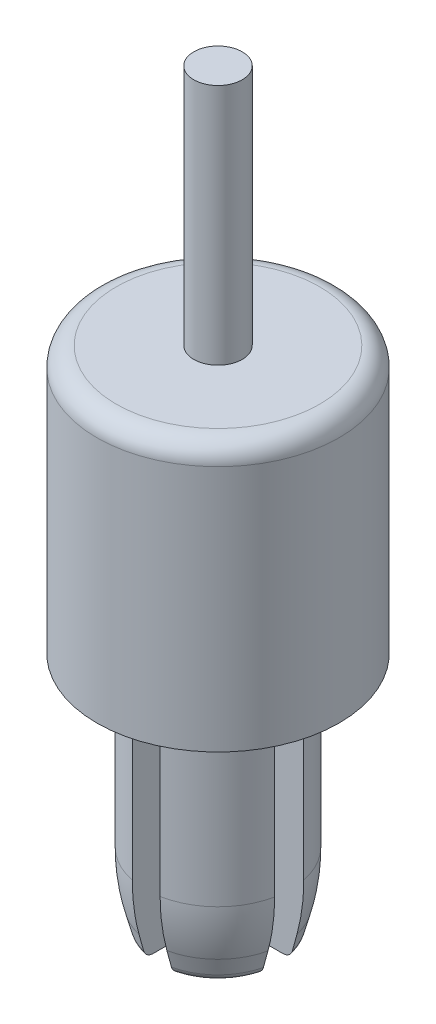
ISO-10303-21;
HEADER;
FILE_DESCRIPTION(('STEP AP214'),'2;1');
FILE_NAME('part.step','',(''),(''),'','','');
FILE_SCHEMA(('AUTOMOTIVE_DESIGN { 1 0 10303 214 1 1 1 1 }'));
ENDSEC;
DATA;
#1=APPLICATION_CONTEXT('core data for automotive mechanical design processes');
#2=APPLICATION_PROTOCOL_DEFINITION('international standard','automotive_design',2000,#1);
#3=PRODUCT_CONTEXT('',#1,'mechanical');
#4=PRODUCT('Part','Part','',(#3));
#5=PRODUCT_RELATED_PRODUCT_CATEGORY('part','',(#4));
#6=PRODUCT_DEFINITION_FORMATION('','',#4);
#7=PRODUCT_DEFINITION_CONTEXT('part definition',#1,'design');
#8=PRODUCT_DEFINITION('design','',#6,#7);
#9=PRODUCT_DEFINITION_SHAPE('','',#8);
#10=(LENGTH_UNIT() NAMED_UNIT(*) SI_UNIT(.MILLI.,.METRE.));
#11=(NAMED_UNIT(*) PLANE_ANGLE_UNIT() SI_UNIT($,.RADIAN.));
#12=(NAMED_UNIT(*) SI_UNIT($,.STERADIAN.) SOLID_ANGLE_UNIT());
#13=UNCERTAINTY_MEASURE_WITH_UNIT(LENGTH_MEASURE(1.E-05),#10,'distance_accuracy_value','');
#14=(GEOMETRIC_REPRESENTATION_CONTEXT(3) GLOBAL_UNCERTAINTY_ASSIGNED_CONTEXT((#13)) GLOBAL_UNIT_ASSIGNED_CONTEXT((#10,
#11,#12)) REPRESENTATION_CONTEXT('',''));
#15=CARTESIAN_POINT('',(0.,0.,0.));
#16=DIRECTION('',(0.,0.,1.));
#17=DIRECTION('',(1.,0.,0.));
#18=AXIS2_PLACEMENT_3D('',#15,#16,#17);
#19=CARTESIAN_POINT('',(0.,20.,0.));
#20=DIRECTION('',(0.,1.,0.));
#21=DIRECTION('',(-1.,0.,0.));
#22=AXIS2_PLACEMENT_3D('',#19,#20,#21);
#23=CYLINDRICAL_SURFACE('',#22,7.5);
#24=DIRECTION('',(0.,1.,0.));
#25=VECTOR('',#24,1.);
#26=CARTESIAN_POINT('',(-1.5,-25.,7.34846922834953));
#27=LINE('',#26,#25);
#28=CARTESIAN_POINT('',(-1.5,0.,7.34846922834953));
#29=VERTEX_POINT('',#28);
#30=CARTESIAN_POINT('',(-1.5,20.,7.34846922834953));
#31=VERTEX_POINT('',#30);
#32=EDGE_CURVE('E253',#29,#31,#27,.T.);
#33=ORIENTED_EDGE('',*,*,#32,.T.);
#34=CARTESIAN_POINT('',(0.,20.,0.));
#35=DIRECTION('',(0.,1.,0.));
#36=DIRECTION('',(-1.,0.,0.));
#37=AXIS2_PLACEMENT_3D('',#34,#35,#36);
#38=CIRCLE('',#37,7.5);
#39=CARTESIAN_POINT('',(1.4,20.,7.36817480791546));
#40=VERTEX_POINT('',#39);
#41=EDGE_CURVE('E321',#31,#40,#38,.T.);
#42=ORIENTED_EDGE('',*,*,#41,.T.);
#43=DIRECTION('',(0.,1.,0.));
#44=VECTOR('',#43,1.);
#45=CARTESIAN_POINT('',(1.4,-25.,7.36817480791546));
#46=LINE('',#45,#44);
#47=CARTESIAN_POINT('',(1.4,0.,7.36817480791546));
#48=VERTEX_POINT('',#47);
#49=EDGE_CURVE('E306',#48,#40,#46,.T.);
#50=ORIENTED_EDGE('',*,*,#49,.F.);
#51=CARTESIAN_POINT('',(0.,0.,0.));
#52=DIRECTION('',(0.,1.,0.));
#53=DIRECTION('',(-1.,0.,0.));
#54=AXIS2_PLACEMENT_3D('',#51,#52,#53);
#55=CIRCLE('',#54,7.5);
#56=EDGE_CURVE('E325',#29,#48,#55,.T.);
#57=ORIENTED_EDGE('',*,*,#56,.F.);
#58=EDGE_LOOP('',(#33,#42,#50,#57));
#59=FACE_BOUND('',#58,.T.);
#60=ADVANCED_FACE('F32',(#59),#23,.F.);
#61=CARTESIAN_POINT('',(0.,20.,0.));
#62=DIRECTION('',(0.,1.,0.));
#63=DIRECTION('',(-1.,0.,0.));
#64=AXIS2_PLACEMENT_3D('',#61,#62,#63);
#65=PLANE('',#64);
#66=DIRECTION('',(0.,0.,1.));
#67=VECTOR('',#66,1.);
#68=CARTESIAN_POINT('',(-1.5,20.,-16.6414213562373));
#69=LINE('',#68,#67);
#70=CARTESIAN_POINT('',(-1.5,20.,1.5));
#71=VERTEX_POINT('',#70);
#72=EDGE_CURVE('E246',#71,#31,#69,.T.);
#73=ORIENTED_EDGE('',*,*,#72,.F.);
#74=DIRECTION('',(-1.,0.,0.));
#75=VECTOR('',#74,1.);
#76=CARTESIAN_POINT('',(0.,20.,1.5));
#77=LINE('',#76,#75);
#78=CARTESIAN_POINT('',(-7.34846922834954,20.,1.5));
#79=VERTEX_POINT('',#78);
#80=EDGE_CURVE('E227',#71,#79,#77,.T.);
#81=ORIENTED_EDGE('',*,*,#80,.T.);
#82=CARTESIAN_POINT('',(-7.34846922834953,20.,-1.5));
#83=VERTEX_POINT('',#82);
#84=EDGE_CURVE('E627',#83,#79,#38,.T.);
#85=ORIENTED_EDGE('',*,*,#84,.F.);
#86=DIRECTION('',(-1.,0.,0.));
#87=VECTOR('',#86,1.);
#88=CARTESIAN_POINT('',(0.,20.,-1.5));
#89=LINE('',#88,#87);
#90=CARTESIAN_POINT('',(-1.5,20.,-1.5));
#91=VERTEX_POINT('',#90);
#92=EDGE_CURVE('E258',#91,#83,#89,.T.);
#93=ORIENTED_EDGE('',*,*,#92,.F.);
#94=DIRECTION('',(0.,0.,1.));
#95=VECTOR('',#94,1.);
#96=CARTESIAN_POINT('',(-1.5,20.,-16.6414213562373));
#97=LINE('',#96,#95);
#98=CARTESIAN_POINT('',(-1.5,20.,-7.34846922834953));
#99=VERTEX_POINT('',#98);
#100=EDGE_CURVE('E230',#99,#91,#97,.T.);
#101=ORIENTED_EDGE('',*,*,#100,.F.);
#102=CARTESIAN_POINT('',(1.4,20.,-7.36817480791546));
#103=VERTEX_POINT('',#102);
#104=EDGE_CURVE('E326',#103,#99,#38,.T.);
#105=ORIENTED_EDGE('',*,*,#104,.F.);
#106=DIRECTION('',(0.,0.,1.));
#107=VECTOR('',#106,1.);
#108=CARTESIAN_POINT('',(1.4,20.,-16.6414213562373));
#109=LINE('',#108,#107);
#110=CARTESIAN_POINT('',(1.4,20.,-1.5));
#111=VERTEX_POINT('',#110);
#112=EDGE_CURVE('E276',#103,#111,#109,.T.);
#113=ORIENTED_EDGE('',*,*,#112,.T.);
#114=DIRECTION('',(-1.,0.,0.));
#115=VECTOR('',#114,1.);
#116=CARTESIAN_POINT('',(0.,20.,-1.5));
#117=LINE('',#116,#115);
#118=CARTESIAN_POINT('',(7.34846922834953,20.,-1.5));
#119=VERTEX_POINT('',#118);
#120=EDGE_CURVE('E272',#119,#111,#117,.T.);
#121=ORIENTED_EDGE('',*,*,#120,.F.);
#122=CARTESIAN_POINT('',(7.34846922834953,20.,1.5));
#123=VERTEX_POINT('',#122);
#124=EDGE_CURVE('E322',#123,#119,#38,.T.);
#125=ORIENTED_EDGE('',*,*,#124,.F.);
#126=DIRECTION('',(-1.,0.,0.));
#127=VECTOR('',#126,1.);
#128=CARTESIAN_POINT('',(0.,20.,1.5));
#129=LINE('',#128,#127);
#130=CARTESIAN_POINT('',(1.4,20.,1.5));
#131=VERTEX_POINT('',#130);
#132=EDGE_CURVE('E294',#123,#131,#129,.T.);
#133=ORIENTED_EDGE('',*,*,#132,.T.);
#134=DIRECTION('',(0.,0.,1.));
#135=VECTOR('',#134,1.);
#136=CARTESIAN_POINT('',(1.4,20.,-16.6414213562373));
#137=LINE('',#136,#135);
#138=EDGE_CURVE('E298',#131,#40,#137,.T.);
#139=ORIENTED_EDGE('',*,*,#138,.T.);
#140=ORIENTED_EDGE('',*,*,#41,.F.);
#141=EDGE_LOOP('',(#73,#81,#85,#93,#101,#105,#113,#121,#125,#133,#139,#140));
#142=FACE_BOUND('',#141,.T.);
#143=ADVANCED_FACE('F622',(#142),#65,.F.);
#144=DIRECTION('',(0.,1.,0.));
#145=VECTOR('',#144,1.);
#146=CARTESIAN_POINT('',(-1.5,20.,-7.34846922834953));
#147=LINE('',#146,#145);
#148=CARTESIAN_POINT('',(-1.5,0.,-7.34846922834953));
#149=VERTEX_POINT('',#148);
#150=EDGE_CURVE('E340',#149,#99,#147,.T.);
#151=ORIENTED_EDGE('',*,*,#150,.F.);
#152=CARTESIAN_POINT('',(1.4,0.,-7.36817480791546));
#153=VERTEX_POINT('',#152);
#154=EDGE_CURVE('E653',#153,#149,#55,.T.);
#155=ORIENTED_EDGE('',*,*,#154,.F.);
#156=DIRECTION('',(0.,1.,0.));
#157=VECTOR('',#156,1.);
#158=CARTESIAN_POINT('',(1.4,-25.,-7.36817480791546));
#159=LINE('',#158,#157);
#160=EDGE_CURVE('E279',#153,#103,#159,.T.);
#161=ORIENTED_EDGE('',*,*,#160,.T.);
#162=ORIENTED_EDGE('',*,*,#104,.T.);
#163=EDGE_LOOP('',(#151,#155,#161,#162));
#164=FACE_BOUND('',#163,.T.);
#165=ADVANCED_FACE('F678',(#164),#23,.F.);
#166=ORIENTED_EDGE('',*,*,#84,.T.);
#167=DIRECTION('',(0.,1.,0.));
#168=VECTOR('',#167,1.);
#169=CARTESIAN_POINT('',(-7.34846922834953,-25.,1.5));
#170=LINE('',#169,#168);
#171=CARTESIAN_POINT('',(-7.34846922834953,0.,1.5));
#172=VERTEX_POINT('',#171);
#173=EDGE_CURVE('E242',#172,#79,#170,.T.);
#174=ORIENTED_EDGE('',*,*,#173,.F.);
#175=CARTESIAN_POINT('',(-7.34846922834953,0.,-1.5));
#176=VERTEX_POINT('',#175);
#177=EDGE_CURVE('E1058',#176,#172,#55,.T.);
#178=ORIENTED_EDGE('',*,*,#177,.F.);
#179=DIRECTION('',(0.,1.,0.));
#180=VECTOR('',#179,1.);
#181=CARTESIAN_POINT('',(-7.34846922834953,20.,-1.5));
#182=LINE('',#181,#180);
#183=EDGE_CURVE('E337',#83,#176,#182,.F.);
#184=ORIENTED_EDGE('',*,*,#183,.F.);
#185=EDGE_LOOP('',(#166,#174,#178,#184));
#186=FACE_BOUND('',#185,.T.);
#187=ADVANCED_FACE('F677',(#186),#23,.F.);
#188=DIRECTION('',(0.,1.,0.));
#189=VECTOR('',#188,1.);
#190=CARTESIAN_POINT('',(7.34846922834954,-25.,-1.5));
#191=LINE('',#190,#189);
#192=CARTESIAN_POINT('',(7.34846922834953,0.,-1.5));
#193=VERTEX_POINT('',#192);
#194=EDGE_CURVE('E288',#193,#119,#191,.T.);
#195=ORIENTED_EDGE('',*,*,#194,.F.);
#196=CARTESIAN_POINT('',(7.34846922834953,0.,1.5));
#197=VERTEX_POINT('',#196);
#198=EDGE_CURVE('E331',#197,#193,#55,.T.);
#199=ORIENTED_EDGE('',*,*,#198,.F.);
#200=DIRECTION('',(0.,1.,0.));
#201=VECTOR('',#200,1.);
#202=CARTESIAN_POINT('',(7.34846922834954,-25.,1.5));
#203=LINE('',#202,#201);
#204=EDGE_CURVE('E309',#197,#123,#203,.T.);
#205=ORIENTED_EDGE('',*,*,#204,.T.);
#206=ORIENTED_EDGE('',*,*,#124,.T.);
#207=EDGE_LOOP('',(#195,#199,#205,#206));
#208=FACE_BOUND('',#207,.T.);
#209=ADVANCED_FACE('F649',(#208),#23,.F.);
#210=CARTESIAN_POINT('',(7.5,0.,0.));
#211=DIRECTION('',(0.,1.,0.));
#212=DIRECTION('',(-1.,0.,0.));
#213=AXIS2_PLACEMENT_3D('',#210,#211,#212);
#214=PLANE('',#213);
#215=CARTESIAN_POINT('',(0.,0.,0.));
#216=DIRECTION('',(0.,1.,0.));
#217=DIRECTION('',(-1.,0.,0.));
#218=AXIS2_PLACEMENT_3D('',#215,#216,#217);
#219=CIRCLE('',#218,12.5);
#220=CARTESIAN_POINT('',(-12.5,0.,0.));
#221=VERTEX_POINT('',#220);
#222=EDGE_CURVE('E312',#221,#221,#219,.T.);
#223=ORIENTED_EDGE('',*,*,#222,.F.);
#224=EDGE_LOOP('',(#223));
#225=FACE_BOUND('',#224,.T.);
#226=EDGE_CURVE('E327',#48,#197,#55,.T.);
#227=ORIENTED_EDGE('',*,*,#226,.T.);
#228=ORIENTED_EDGE('',*,*,#198,.T.);
#229=CARTESIAN_POINT('',(0.,0.,0.));
#230=DIRECTION('',(0.,1.,0.));
#231=DIRECTION('',(-1.,0.,0.));
#232=AXIS2_PLACEMENT_3D('',#229,#230,#231);
#233=CIRCLE('',#232,7.5);
#234=EDGE_CURVE('E291',#153,#193,#233,.F.);
#235=ORIENTED_EDGE('',*,*,#234,.F.);
#236=ORIENTED_EDGE('',*,*,#154,.T.);
#237=EDGE_CURVE('E1049',#149,#176,#55,.T.);
#238=ORIENTED_EDGE('',*,*,#237,.T.);
#239=ORIENTED_EDGE('',*,*,#177,.T.);
#240=EDGE_CURVE('E1059',#172,#29,#55,.T.);
#241=ORIENTED_EDGE('',*,*,#240,.T.);
#242=ORIENTED_EDGE('',*,*,#56,.T.);
#243=EDGE_LOOP('',(#227,#228,#235,#236,#238,#239,#241,#242));
#244=FACE_BOUND('',#243,.T.);
#245=ADVANCED_FACE('F655',(#225,#244),#214,.F.);
#246=CARTESIAN_POINT('',(2.49999999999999,52.5,0.));
#247=DIRECTION('',(0.,-1.,0.));
#248=DIRECTION('',(1.,0.,0.));
#249=AXIS2_PLACEMENT_3D('',#246,#247,#248);
#250=PLANE('',#249);
#251=CARTESIAN_POINT('',(0.,52.5,0.));
#252=DIRECTION('',(0.,1.,0.));
#253=DIRECTION('',(-1.,0.,0.));
#254=AXIS2_PLACEMENT_3D('',#251,#252,#253);
#255=CIRCLE('',#254,2.5);
#256=CARTESIAN_POINT('',(-2.50000000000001,52.5,0.));
#257=VERTEX_POINT('',#256);
#258=EDGE_CURVE('E318',#257,#257,#255,.T.);
#259=ORIENTED_EDGE('',*,*,#258,.T.);
#260=EDGE_LOOP('',(#259));
#261=FACE_BOUND('',#260,.T.);
#262=ADVANCED_FACE('F692',(#261),#250,.F.);
#263=CARTESIAN_POINT('',(0.,20.,0.));
#264=DIRECTION('',(0.,1.,0.));
#265=DIRECTION('',(-1.,0.,0.));
#266=AXIS2_PLACEMENT_3D('',#263,#264,#265);
#267=CYLINDRICAL_SURFACE('',#266,2.5);
#268=ORIENTED_EDGE('',*,*,#258,.F.);
#269=EDGE_LOOP('',(#268));
#270=FACE_BOUND('',#269,.T.);
#271=CARTESIAN_POINT('',(0.,27.5,0.));
#272=DIRECTION('',(0.,1.,0.));
#273=DIRECTION('',(-1.,0.,0.));
#274=AXIS2_PLACEMENT_3D('',#271,#272,#273);
#275=CIRCLE('',#274,2.5);
#276=CARTESIAN_POINT('',(-2.5,27.5,0.));
#277=VERTEX_POINT('',#276);
#278=EDGE_CURVE('E315',#277,#277,#275,.T.);
#279=ORIENTED_EDGE('',*,*,#278,.T.);
#280=EDGE_LOOP('',(#279));
#281=FACE_BOUND('',#280,.T.);
#282=ADVANCED_FACE('F697',(#270,#281),#267,.T.);
#283=CARTESIAN_POINT('',(2.5,27.5,0.));
#284=DIRECTION('',(0.,-1.,0.));
#285=DIRECTION('',(1.,0.,0.));
#286=AXIS2_PLACEMENT_3D('',#283,#284,#285);
#287=PLANE('',#286);
#288=CARTESIAN_POINT('',(0.,27.5,0.));
#289=DIRECTION('',(0.,-1.,0.));
#290=DIRECTION('',(1.,0.,0.));
#291=AXIS2_PLACEMENT_3D('',#288,#289,#290);
#292=CIRCLE('',#291,10.5);
#293=CARTESIAN_POINT('',(10.5,27.5,0.));
#294=VERTEX_POINT('',#293);
#295=EDGE_CURVE('E330',#294,#294,#292,.F.);
#296=ORIENTED_EDGE('',*,*,#295,.T.);
#297=EDGE_LOOP('',(#296));
#298=FACE_BOUND('',#297,.T.);
#299=ORIENTED_EDGE('',*,*,#278,.F.);
#300=EDGE_LOOP('',(#299));
#301=FACE_BOUND('',#300,.T.);
#302=ADVANCED_FACE('F708',(#298,#301),#287,.F.);
#303=CARTESIAN_POINT('',(0.,20.,0.));
#304=DIRECTION('',(0.,1.,0.));
#305=DIRECTION('',(-1.,0.,0.));
#306=AXIS2_PLACEMENT_3D('',#303,#304,#305);
#307=CYLINDRICAL_SURFACE('',#306,12.5);
#308=CARTESIAN_POINT('',(0.,25.5,0.));
#309=DIRECTION('',(0.,-1.,0.));
#310=DIRECTION('',(1.,0.,0.));
#311=AXIS2_PLACEMENT_3D('',#308,#309,#310);
#312=CIRCLE('',#311,12.5);
#313=CARTESIAN_POINT('',(12.5,25.5,0.));
#314=VERTEX_POINT('',#313);
#315=EDGE_CURVE('E334',#314,#314,#312,.T.);
#316=ORIENTED_EDGE('',*,*,#315,.T.);
#317=EDGE_LOOP('',(#316));
#318=FACE_BOUND('',#317,.T.);
#319=ORIENTED_EDGE('',*,*,#222,.T.);
#320=EDGE_LOOP('',(#319));
#321=FACE_BOUND('',#320,.T.);
#322=ADVANCED_FACE('F498',(#318,#321),#307,.T.);
#323=CARTESIAN_POINT('',(0.,25.5,0.));
#324=DIRECTION('',(0.,-1.,0.));
#325=DIRECTION('',(1.,0.,0.));
#326=AXIS2_PLACEMENT_3D('',#323,#324,#325);
#327=TOROIDAL_SURFACE('',#326,10.5,2.);
#328=ORIENTED_EDGE('',*,*,#315,.F.);
#329=EDGE_LOOP('',(#328));
#330=FACE_BOUND('',#329,.T.);
#331=ORIENTED_EDGE('',*,*,#295,.F.);
#332=EDGE_LOOP('',(#331));
#333=FACE_BOUND('',#332,.T.);
#334=ADVANCED_FACE('F701',(#330,#333),#327,.T.);
#335=CARTESIAN_POINT('',(0.,-25.,0.));
#336=DIRECTION('',(0.,1.,0.));
#337=DIRECTION('',(-1.,0.,0.));
#338=AXIS2_PLACEMENT_3D('',#335,#336,#337);
#339=CYLINDRICAL_SURFACE('',#338,7.5);
#340=CARTESIAN_POINT('',(1.4,-17.3669500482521,7.36817480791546));
#341=VERTEX_POINT('',#340);
#342=EDGE_CURVE('E307',#341,#48,#46,.T.);
#343=ORIENTED_EDGE('',*,*,#342,.F.);
#344=CARTESIAN_POINT('',(0.,-17.3669500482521,0.));
#345=DIRECTION('',(0.,-1.,0.));
#346=DIRECTION('',(1.,0.,0.));
#347=AXIS2_PLACEMENT_3D('',#344,#345,#346);
#348=CIRCLE('',#347,7.5);
#349=CARTESIAN_POINT('',(7.34846922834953,-17.3669500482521,1.5));
#350=VERTEX_POINT('',#349);
#351=EDGE_CURVE('E488',#341,#350,#348,.F.);
#352=ORIENTED_EDGE('',*,*,#351,.T.);
#353=EDGE_CURVE('E310',#350,#197,#203,.T.);
#354=ORIENTED_EDGE('',*,*,#353,.T.);
#355=ORIENTED_EDGE('',*,*,#226,.F.);
#356=EDGE_LOOP('',(#343,#352,#354,#355));
#357=FACE_BOUND('',#356,.T.);
#358=ADVANCED_FACE('F422',(#357),#339,.T.);
#359=CARTESIAN_POINT('',(0.,-25.,1.5));
#360=DIRECTION('',(0.,0.,-1.));
#361=DIRECTION('',(-1.,0.,0.));
#362=AXIS2_PLACEMENT_3D('',#359,#360,#361);
#363=PLANE('',#362);
#364=CARTESIAN_POINT('',(7.34846922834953,-20.,1.5));
#365=CARTESIAN_POINT('',(7.23448410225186,-20.4167994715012,1.5));
#366=CARTESIAN_POINT('',(7.12040230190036,-20.8335725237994,1.5));
#367=CARTESIAN_POINT('',(6.89201056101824,-21.6670559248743,1.5));
#368=CARTESIAN_POINT('',(6.77770062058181,-22.0837662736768,1.5));
#369=CARTESIAN_POINT('',(6.54881770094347,-22.9171147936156,1.5));
#370=CARTESIAN_POINT('',(6.434244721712,-23.3337529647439,1.5));
#371=CARTESIAN_POINT('',(6.20478802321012,-24.1669439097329,1.5));
#372=CARTESIAN_POINT('',(6.08990430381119,-24.5834966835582,1.5));
#373=CARTESIAN_POINT('',(5.97484140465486,-25.,1.5));
#374=B_SPLINE_CURVE_WITH_KNOTS('',3,(#364,#365,#366,#367,#368,#369,#370,#371,#372,#373),
.UNSPECIFIED.,.F.,.F.,(4,2,2,2,4),(0.,1.29631389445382,2.59262725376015,3.88894075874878,
5.18525479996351),.UNSPECIFIED.);
#375=CARTESIAN_POINT('',(6.65147860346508,-22.5433309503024,1.5));
#376=VERTEX_POINT('',#375);
#377=CARTESIAN_POINT('',(6.17940206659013,-24.2588190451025,1.5));
#378=VERTEX_POINT('',#377);
#379=EDGE_CURVE('E502',#376,#378,#374,.T.);
#380=ORIENTED_EDGE('',*,*,#379,.T.);
#381=CARTESIAN_POINT('',(6.17940206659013,-24.2588190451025,1.5));
#382=CARTESIAN_POINT('',(6.17197997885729,-24.2857375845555,1.5));
#383=CARTESIAN_POINT('',(6.16340654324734,-24.3123239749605,1.5));
#384=CARTESIAN_POINT('',(6.14402695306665,-24.3646656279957,1.5));
#385=CARTESIAN_POINT('',(6.13322114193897,-24.3904210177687,1.5));
#386=CARTESIAN_POINT('',(6.0976127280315,-24.4660825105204,1.5));
#387=CARTESIAN_POINT('',(6.06958312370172,-24.5145136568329,1.5));
#388=CARTESIAN_POINT('',(6.00584614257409,-24.6059771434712,1.5));
#389=CARTESIAN_POINT('',(5.9701393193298,-24.6490098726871,1.5));
#390=CARTESIAN_POINT('',(5.89212987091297,-24.7286037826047,1.5));
#391=CARTESIAN_POINT('',(5.84982771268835,-24.7651654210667,1.5));
#392=CARTESIAN_POINT('',(5.75904087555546,-24.831536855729,1.5));
#393=CARTESIAN_POINT('',(5.71045776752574,-24.8612117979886,1.5));
#394=CARTESIAN_POINT('',(5.60909371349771,-24.912290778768,1.5));
#395=CARTESIAN_POINT('',(5.55631036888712,-24.9336900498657,1.5));
#396=CARTESIAN_POINT('',(5.45013707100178,-24.967091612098,1.5));
#397=CARTESIAN_POINT('',(5.39685189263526,-24.979429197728,1.5));
#398=CARTESIAN_POINT('',(5.28908280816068,-24.9958935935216,1.5));
#399=CARTESIAN_POINT('',(5.23460019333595,-25.0000288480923,1.5));
#400=CARTESIAN_POINT('',(5.18012182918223,-25.,1.5));
#401=B_SPLINE_CURVE_WITH_KNOTS('',3,(#381,#382,#383,#384,#385,#386,#387,#388,#389,#390,#391,
#392,#393,#394,#395,#396,#397,#398,#399,#400),.UNSPECIFIED.,.F.,.F.,(4,2,2,2,2,2,2,2,2,4),(0.,
0.0837157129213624,0.167418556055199,0.334425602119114,0.501420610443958,0.66840380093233,
0.838423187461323,1.00854037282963,1.17199302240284,1.33527730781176),.UNSPECIFIED.);
#402=CARTESIAN_POINT('',(5.18012182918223,-25.,1.5));
#403=VERTEX_POINT('',#402);
#404=EDGE_CURVE('E11',#378,#403,#401,.T.);
#405=ORIENTED_EDGE('',*,*,#404,.T.);
#406=DIRECTION('',(-1.,0.,0.));
#407=VECTOR('',#406,1.);
#408=CARTESIAN_POINT('',(0.,-25.,1.5));
#409=LINE('',#408,#407);
#410=CARTESIAN_POINT('',(1.4,-25.,1.5));
#411=VERTEX_POINT('',#410);
#412=EDGE_CURVE('E295',#403,#411,#409,.T.);
#413=ORIENTED_EDGE('',*,*,#412,.T.);
#414=DIRECTION('',(0.,1.,0.));
#415=VECTOR('',#414,1.);
#416=CARTESIAN_POINT('',(1.4,-25.,1.5));
#417=LINE('',#416,#415);
#418=EDGE_CURVE('E300',#411,#131,#417,.T.);
#419=ORIENTED_EDGE('',*,*,#418,.T.);
#420=ORIENTED_EDGE('',*,*,#132,.F.);
#421=ORIENTED_EDGE('',*,*,#204,.F.);
#422=ORIENTED_EDGE('',*,*,#353,.F.);
#423=CARTESIAN_POINT('',(7.34846922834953,-17.3669500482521,1.5));
#424=CARTESIAN_POINT('',(7.34848658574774,-17.8044896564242,1.5));
#425=CARTESIAN_POINT('',(7.33381510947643,-18.2420279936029,1.5));
#426=CARTESIAN_POINT('',(7.27535594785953,-19.1131917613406,1.5));
#427=CARTESIAN_POINT('',(7.23169858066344,-19.5468259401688,1.5));
#428=CARTESIAN_POINT('',(7.11552603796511,-20.4102160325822,1.5));
#429=CARTESIAN_POINT('',(7.04301071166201,-20.8399719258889,1.5));
#430=CARTESIAN_POINT('',(6.86900371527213,-21.6955840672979,1.5));
#431=CARTESIAN_POINT('',(6.7673835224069,-22.1214141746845,1.5));
#432=CARTESIAN_POINT('',(6.65147860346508,-22.5433309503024,1.5));
#433=B_SPLINE_CURVE_WITH_KNOTS('',3,(#423,#424,#425,#426,#427,#428,#429,#430,#431,#432),
.UNSPECIFIED.,.F.,.F.,(4,2,2,2,4),(0.,1.312370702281,2.6188806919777,3.9253975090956,
5.23777509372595),.UNSPECIFIED.);
#434=EDGE_CURVE('E490',#350,#376,#433,.T.);
#435=ORIENTED_EDGE('',*,*,#434,.T.);
#436=EDGE_LOOP('',(#380,#405,#413,#419,#420,#421,#422,#435));
#437=FACE_BOUND('',#436,.T.);
#438=ADVANCED_FACE('F420',(#437),#363,.T.);
#439=CARTESIAN_POINT('',(1.4,-25.,-16.6414213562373));
#440=DIRECTION('',(-1.,0.,0.));
#441=DIRECTION('',(0.,-1.,0.));
#442=AXIS2_PLACEMENT_3D('',#439,#440,#441);
#443=PLANE('',#442);
#444=DIRECTION('',(0.,0.,1.));
#445=VECTOR('',#444,1.);
#446=CARTESIAN_POINT('',(1.4,-25.,-16.6414213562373));
#447=LINE('',#446,#445);
#448=CARTESIAN_POINT('',(1.4,-25.,5.20803822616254));
#449=VERTEX_POINT('',#448);
#450=EDGE_CURVE('E297',#411,#449,#447,.T.);
#451=ORIENTED_EDGE('',*,*,#450,.T.);
#452=CARTESIAN_POINT('',(1.4,-25.,5.20803822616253));
#453=CARTESIAN_POINT('',(1.4,-25.0000447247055,5.26736917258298));
#454=CARTESIAN_POINT('',(1.4,-24.995077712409,5.32670693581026));
#455=CARTESIAN_POINT('',(1.4,-24.9753547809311,5.44376996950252));
#456=CARTESIAN_POINT('',(1.4,-24.9605927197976,5.50149420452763));
#457=CARTESIAN_POINT('',(1.4,-24.9214959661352,5.61367945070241));
#458=CARTESIAN_POINT('',(1.4,-24.8971520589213,5.66813726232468));
#459=CARTESIAN_POINT('',(1.4,-24.8394948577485,5.77204498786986));
#460=CARTESIAN_POINT('',(1.4,-24.8061871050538,5.82149796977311));
#461=CARTESIAN_POINT('',(1.4,-24.7322219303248,5.91292647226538));
#462=CARTESIAN_POINT('',(1.4,-24.6917252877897,5.95503205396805));
#463=CARTESIAN_POINT('',(1.4,-24.6040507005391,6.03160592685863));
#464=CARTESIAN_POINT('',(1.4,-24.5568744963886,6.06607620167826));
#465=CARTESIAN_POINT('',(1.4,-24.4683728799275,6.11949891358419));
#466=CARTESIAN_POINT('',(1.4,-24.4280902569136,6.14019766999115));
#467=CARTESIAN_POINT('',(1.4,-24.3450977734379,6.17588306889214));
#468=CARTESIAN_POINT('',(1.4,-24.3023892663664,6.19087286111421));
#469=CARTESIAN_POINT('',(1.4,-24.2588190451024,6.20282273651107));
#470=B_SPLINE_CURVE_WITH_KNOTS('',3,(#452,#453,#454,#455,#456,#457,#458,#459,#460,#461,#462,
#463,#464,#465,#466,#467,#468,#469),.UNSPECIFIED.,.F.,.F.,(4,2,2,2,2,2,2,2,4),(0.,
0.177797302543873,0.355706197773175,0.533786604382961,0.711757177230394,0.88615884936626,
1.06051515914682,1.19597290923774,1.331355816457),.UNSPECIFIED.);
#471=CARTESIAN_POINT('',(1.4,-24.2588190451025,6.20282273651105));
#472=VERTEX_POINT('',#471);
#473=EDGE_CURVE('E59',#449,#472,#470,.T.);
#474=ORIENTED_EDGE('',*,*,#473,.T.);
#475=CARTESIAN_POINT('',(1.4,-25.,5.99906074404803));
#476=CARTESIAN_POINT('',(1.4,-24.5834737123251,6.11366573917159));
#477=CARTESIAN_POINT('',(1.4,-24.1669049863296,6.2281163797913));
#478=CARTESIAN_POINT('',(1.4,-23.3336941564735,6.45674976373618));
#479=CARTESIAN_POINT('',(1.4,-22.9170520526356,6.57093250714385));
#480=CARTESIAN_POINT('',(1.4,-22.0837057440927,6.79907096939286));
#481=CARTESIAN_POINT('',(1.4,-21.667001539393,6.91302668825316));
#482=CARTESIAN_POINT('',(1.4,-20.8335391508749,7.14074106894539));
#483=CARTESIAN_POINT('',(1.4,-20.41678096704,7.25449973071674));
#484=CARTESIAN_POINT('',(1.4,-20.,7.36817480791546));
#485=B_SPLINE_CURVE_WITH_KNOTS('',3,(#475,#476,#477,#478,#479,#480,#481,#482,#483,#484),
.UNSPECIFIED.,.F.,.F.,(4,2,2,2,4),(0.,1.29601538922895,2.59203037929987,3.88804526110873,
5.18406054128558),.UNSPECIFIED.);
#486=CARTESIAN_POINT('',(1.4,-22.5433309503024,6.67324266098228));
#487=VERTEX_POINT('',#486);
#488=EDGE_CURVE('E426',#472,#487,#485,.T.);
#489=ORIENTED_EDGE('',*,*,#488,.T.);
#490=CARTESIAN_POINT('',(1.39999999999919,-22.5433309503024,6.67324266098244));
#491=CARTESIAN_POINT('',(1.39999999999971,-22.1213543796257,6.78878703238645));
#492=CARTESIAN_POINT('',(1.39999999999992,-21.6954905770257,6.8900991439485));
#493=CARTESIAN_POINT('',(1.40000000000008,-20.8398368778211,7.06358993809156));
#494=CARTESIAN_POINT('',(1.40000000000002,-20.4100727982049,7.13589593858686));
#495=CARTESIAN_POINT('',(1.39999999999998,-19.5466882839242,7.25173551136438));
#496=CARTESIAN_POINT('',(1.39999999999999,-19.1130678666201,7.29526921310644));
#497=CARTESIAN_POINT('',(1.40000000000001,-18.2419545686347,7.35356232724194));
#498=CARTESIAN_POINT('',(1.40000000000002,-17.8044530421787,7.36819258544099));
#499=CARTESIAN_POINT('',(1.4,-17.3669500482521,7.36817480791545));
#500=B_SPLINE_CURVE_WITH_KNOTS('',3,(#490,#491,#492,#493,#494,#495,#496,#497,#498,#499),
.UNSPECIFIED.,.F.,.F.,(4,2,2,2,4),(0.,1.31226785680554,2.61871097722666,3.9251482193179,
5.23741015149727),.UNSPECIFIED.);
#501=EDGE_CURVE('E406',#487,#341,#500,.T.);
#502=ORIENTED_EDGE('',*,*,#501,.T.);
#503=ORIENTED_EDGE('',*,*,#342,.T.);
#504=ORIENTED_EDGE('',*,*,#49,.T.);
#505=ORIENTED_EDGE('',*,*,#138,.F.);
#506=ORIENTED_EDGE('',*,*,#418,.F.);
#507=EDGE_LOOP('',(#451,#474,#489,#502,#503,#504,#505,#506));
#508=FACE_BOUND('',#507,.T.);
#509=ADVANCED_FACE('F414',(#508),#443,.T.);
#510=CARTESIAN_POINT('',(0.,-25.,-16.6414213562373));
#511=DIRECTION('',(0.,-1.,0.));
#512=DIRECTION('',(1.,0.,0.));
#513=AXIS2_PLACEMENT_3D('',#510,#511,#512);
#514=PLANE('',#513);
#515=ORIENTED_EDGE('',*,*,#412,.F.);
#516=CARTESIAN_POINT('',(0.,-25.,0.));
#517=DIRECTION('',(0.,-1.,0.));
#518=DIRECTION('',(1.,0.,0.));
#519=AXIS2_PLACEMENT_3D('',#516,#517,#518);
#520=CIRCLE('',#519,5.39292704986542);
#521=EDGE_CURVE('E438',#403,#449,#520,.T.);
#522=ORIENTED_EDGE('',*,*,#521,.T.);
#523=ORIENTED_EDGE('',*,*,#450,.F.);
#524=EDGE_LOOP('',(#515,#522,#523));
#525=FACE_BOUND('',#524,.T.);
#526=ADVANCED_FACE('F419',(#525),#514,.T.);
#527=CARTESIAN_POINT('',(0.,-25.,0.));
#528=DIRECTION('',(0.,1.,0.));
#529=DIRECTION('',(-1.,0.,0.));
#530=AXIS2_PLACEMENT_3D('',#527,#528,#529);
#531=CYLINDRICAL_SURFACE('',#530,7.5);
#532=CARTESIAN_POINT('',(7.34846922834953,-17.3669500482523,-1.5));
#533=VERTEX_POINT('',#532);
#534=EDGE_CURVE('E289',#533,#193,#191,.T.);
#535=ORIENTED_EDGE('',*,*,#534,.F.);
#536=CARTESIAN_POINT('',(0.,-17.3669500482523,0.));
#537=DIRECTION('',(0.,-1.,0.));
#538=DIRECTION('',(1.,0.,0.));
#539=AXIS2_PLACEMENT_3D('',#536,#537,#538);
#540=CIRCLE('',#539,7.5);
#541=CARTESIAN_POINT('',(1.4,-17.3669500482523,-7.36817480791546));
#542=VERTEX_POINT('',#541);
#543=EDGE_CURVE('E381',#533,#542,#540,.F.);
#544=ORIENTED_EDGE('',*,*,#543,.T.);
#545=EDGE_CURVE('E283',#542,#153,#159,.T.);
#546=ORIENTED_EDGE('',*,*,#545,.T.);
#547=ORIENTED_EDGE('',*,*,#234,.T.);
#548=EDGE_LOOP('',(#535,#544,#546,#547));
#549=FACE_BOUND('',#548,.T.);
#550=ADVANCED_FACE('F670',(#549),#531,.T.);
#551=CARTESIAN_POINT('',(0.,-25.,-1.5));
#552=DIRECTION('',(0.,0.,-1.));
#553=DIRECTION('',(-1.,0.,0.));
#554=AXIS2_PLACEMENT_3D('',#551,#552,#553);
#555=PLANE('',#554);
#556=DIRECTION('',(-1.,0.,0.));
#557=VECTOR('',#556,1.);
#558=CARTESIAN_POINT('',(0.,-25.,-1.5));
#559=LINE('',#558,#557);
#560=CARTESIAN_POINT('',(5.18012182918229,-25.,-1.5));
#561=VERTEX_POINT('',#560);
#562=CARTESIAN_POINT('',(1.4,-25.,-1.5));
#563=VERTEX_POINT('',#562);
#564=EDGE_CURVE('E273',#561,#563,#559,.T.);
#565=ORIENTED_EDGE('',*,*,#564,.F.);
#566=CARTESIAN_POINT('',(5.18012182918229,-25.,-1.5));
#567=CARTESIAN_POINT('',(5.23994820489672,-25.0000442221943,-1.5));
#568=CARTESIAN_POINT('',(5.29978489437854,-24.9950485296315,-1.5));
#569=CARTESIAN_POINT('',(5.41784700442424,-24.9751925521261,-1.5));
#570=CARTESIAN_POINT('',(5.47607107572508,-24.960324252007,-1.5));
#571=CARTESIAN_POINT('',(5.58923285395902,-24.9209182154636,-1.5));
#572=CARTESIAN_POINT('',(5.64416703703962,-24.8963703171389,-1.5));
#573=CARTESIAN_POINT('',(5.74896266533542,-24.8381952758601,-1.5));
#574=CARTESIAN_POINT('',(5.79882746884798,-24.8045741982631,-1.5));
#575=CARTESIAN_POINT('',(5.89081231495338,-24.7300036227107,-1.5));
#576=CARTESIAN_POINT('',(5.93308627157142,-24.6892440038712,-1.5));
#577=CARTESIAN_POINT('',(6.00990836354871,-24.6009904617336,-1.5));
#578=CARTESIAN_POINT('',(6.04445904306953,-24.5534987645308,-1.5));
#579=CARTESIAN_POINT('',(6.09744460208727,-24.4651974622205,-1.5));
#580=CARTESIAN_POINT('',(6.11775763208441,-24.4255018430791,-1.5));
#581=CARTESIAN_POINT('',(6.15283035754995,-24.343756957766,-1.5));
#582=CARTESIAN_POINT('',(6.16759317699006,-24.3017090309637,-1.5));
#583=CARTESIAN_POINT('',(6.17940206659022,-24.2588190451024,-1.5));
#584=B_SPLINE_CURVE_WITH_KNOTS('',3,(#566,#567,#568,#569,#570,#571,#572,#573,#574,#575,#576,
#577,#578,#579,#580,#581,#582,#583),.UNSPECIFIED.,.F.,.F.,(4,2,2,2,2,2,2,2,4),(0.,
0.179288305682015,0.358722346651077,0.538345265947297,0.717848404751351,0.893151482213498,
1.06839672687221,1.2017776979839,1.33508348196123),.UNSPECIFIED.);
#585=CARTESIAN_POINT('',(6.1794020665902,-24.2588190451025,-1.5));
#586=VERTEX_POINT('',#585);
#587=EDGE_CURVE('E598',#561,#586,#584,.T.);
#588=ORIENTED_EDGE('',*,*,#587,.T.);
#589=CARTESIAN_POINT('',(5.97484140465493,-25.,-1.5));
#590=CARTESIAN_POINT('',(6.08990430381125,-24.5834966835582,-1.5));
#591=CARTESIAN_POINT('',(6.20478802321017,-24.1669439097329,-1.5));
#592=CARTESIAN_POINT('',(6.43424472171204,-23.333752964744,-1.5));
#593=CARTESIAN_POINT('',(6.54881770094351,-22.9171147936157,-1.5));
#594=CARTESIAN_POINT('',(6.77770062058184,-22.0837662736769,-1.5));
#595=CARTESIAN_POINT('',(6.89201056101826,-21.6670559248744,-1.5));
#596=CARTESIAN_POINT('',(7.12040230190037,-20.8335725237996,-1.5));
#597=CARTESIAN_POINT('',(7.23448410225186,-20.4167994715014,-1.5));
#598=CARTESIAN_POINT('',(7.34846922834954,-20.0000000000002,-1.5));
#599=B_SPLINE_CURVE_WITH_KNOTS('',3,(#589,#590,#591,#592,#593,#594,#595,#596,#597,#598),
.UNSPECIFIED.,.F.,.F.,(4,2,2,2,4),(0.,1.29631404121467,2.59262754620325,3.88894090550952,
5.18525479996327),.UNSPECIFIED.);
#600=CARTESIAN_POINT('',(6.6514786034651,-22.5433309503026,-1.5));
#601=VERTEX_POINT('',#600);
#602=EDGE_CURVE('E507',#586,#601,#599,.T.);
#603=ORIENTED_EDGE('',*,*,#602,.T.);
#604=CARTESIAN_POINT('',(6.65147860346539,-22.5433309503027,-1.49999999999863));
#605=CARTESIAN_POINT('',(6.76738352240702,-22.1214141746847,-1.49999999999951));
#606=CARTESIAN_POINT('',(6.86900371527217,-21.6955840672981,-1.49999999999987));
#607=CARTESIAN_POINT('',(7.04301071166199,-20.8399719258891,-1.50000000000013));
#608=CARTESIAN_POINT('',(7.11552603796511,-20.4102160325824,-1.50000000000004));
#609=CARTESIAN_POINT('',(7.23169858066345,-19.546825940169,-1.49999999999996));
#610=CARTESIAN_POINT('',(7.27535594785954,-19.1131917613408,-1.49999999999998));
#611=CARTESIAN_POINT('',(7.33381510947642,-18.2420279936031,-1.50000000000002));
#612=CARTESIAN_POINT('',(7.34848658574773,-17.8044896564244,-1.50000000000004));
#613=CARTESIAN_POINT('',(7.34846922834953,-17.3669500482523,-1.5));
#614=B_SPLINE_CURVE_WITH_KNOTS('',3,(#604,#605,#606,#607,#608,#609,#610,#611,#612,#613),
.UNSPECIFIED.,.F.,.F.,(4,2,2,2,4),(0.,1.31237758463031,2.6188944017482,3.9254043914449,
5.23777509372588),.UNSPECIFIED.);
#615=EDGE_CURVE('E591',#601,#533,#614,.T.);
#616=ORIENTED_EDGE('',*,*,#615,.T.);
#617=ORIENTED_EDGE('',*,*,#534,.T.);
#618=ORIENTED_EDGE('',*,*,#194,.T.);
#619=ORIENTED_EDGE('',*,*,#120,.T.);
#620=DIRECTION('',(0.,1.,0.));
#621=VECTOR('',#620,1.);
#622=CARTESIAN_POINT('',(1.4,-25.,-1.5));
#623=LINE('',#622,#621);
#624=EDGE_CURVE('E285',#563,#111,#623,.T.);
#625=ORIENTED_EDGE('',*,*,#624,.F.);
#626=EDGE_LOOP('',(#565,#588,#603,#616,#617,#618,#619,#625));
#627=FACE_BOUND('',#626,.T.);
#628=ADVANCED_FACE('F574',(#627),#555,.F.);
#629=CARTESIAN_POINT('',(1.4,-25.,-16.6414213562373));
#630=DIRECTION('',(-1.,0.,0.));
#631=DIRECTION('',(0.,-1.,0.));
#632=AXIS2_PLACEMENT_3D('',#629,#630,#631);
#633=PLANE('',#632);
#634=CARTESIAN_POINT('',(1.4,-20.0000000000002,-7.36817480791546));
#635=CARTESIAN_POINT('',(1.4,-20.4167809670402,-7.25449973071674));
#636=CARTESIAN_POINT('',(1.4,-20.8335391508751,-7.1407410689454));
#637=CARTESIAN_POINT('',(1.4,-21.6670015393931,-6.91302668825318));
#638=CARTESIAN_POINT('',(1.4,-22.0837057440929,-6.79907096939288));
#639=CARTESIAN_POINT('',(1.4,-22.9170520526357,-6.57093250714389));
#640=CARTESIAN_POINT('',(1.4,-23.3336941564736,-6.45674976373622));
#641=CARTESIAN_POINT('',(1.4,-24.1669049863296,-6.22811637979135));
#642=CARTESIAN_POINT('',(1.4,-24.5834737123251,-6.11366573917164));
#643=CARTESIAN_POINT('',(1.4,-25.,-5.99906074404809));
#644=B_SPLINE_CURVE_WITH_KNOTS('',3,(#634,#635,#636,#637,#638,#639,#640,#641,#642,#643),
.UNSPECIFIED.,.F.,.F.,(4,2,2,2,4),(0.,1.29601528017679,2.59203016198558,3.88804515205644,
5.18406054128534),.UNSPECIFIED.);
#645=CARTESIAN_POINT('',(1.4,-22.5433309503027,-6.67324266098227));
#646=VERTEX_POINT('',#645);
#647=CARTESIAN_POINT('',(1.4,-24.2588190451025,-6.2028227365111));
#648=VERTEX_POINT('',#647);
#649=EDGE_CURVE('E579',#646,#648,#644,.T.);
#650=ORIENTED_EDGE('',*,*,#649,.T.);
#651=CARTESIAN_POINT('',(1.4,-24.2588190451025,-6.2028227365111));
#652=CARTESIAN_POINT('',(1.4,-24.2857703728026,-6.19541961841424));
#653=CARTESIAN_POINT('',(1.4,-24.3123911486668,-6.18686623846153));
#654=CARTESIAN_POINT('',(1.4,-24.3648049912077,-6.16752717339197));
#655=CARTESIAN_POINT('',(1.4,-24.3905981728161,-6.1567417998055));
#656=CARTESIAN_POINT('',(1.4,-24.466383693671,-6.12118985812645));
#657=CARTESIAN_POINT('',(1.4,-24.5149048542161,-6.09319349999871));
#658=CARTESIAN_POINT('',(1.4,-24.6065527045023,-6.02950052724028));
#659=CARTESIAN_POINT('',(1.4,-24.6496794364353,-5.99380397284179));
#660=CARTESIAN_POINT('',(1.4,-24.729443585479,-5.91578462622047));
#661=CARTESIAN_POINT('',(1.4,-24.7660816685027,-5.87346251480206));
#662=CARTESIAN_POINT('',(1.4,-24.8324899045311,-5.78270791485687));
#663=CARTESIAN_POINT('',(1.4,-24.8621423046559,-5.7341893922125));
#664=CARTESIAN_POINT('',(1.4,-24.9131489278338,-5.63294325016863));
#665=CARTESIAN_POINT('',(1.4,-24.934498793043,-5.58021343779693));
#666=CARTESIAN_POINT('',(1.4,-24.9675746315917,-5.47472161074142));
#667=CARTESIAN_POINT('',(1.4,-24.9797278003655,-5.42209258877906));
#668=CARTESIAN_POINT('',(1.4,-24.9959508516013,-5.31565399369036));
#669=CARTESIAN_POINT('',(1.4,-25.0000284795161,-5.26184560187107));
#670=CARTESIAN_POINT('',(1.4,-25.,-5.2080382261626));
#671=B_SPLINE_CURVE_WITH_KNOTS('',3,(#651,#652,#653,#654,#655,#656,#657,#658,#659,#660,#661,
#662,#663,#664,#665,#666,#667,#668,#669,#670),.UNSPECIFIED.,.F.,.F.,(4,2,2,2,2,2,2,2,2,4),(0.,
0.0837956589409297,0.167579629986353,0.334770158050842,0.501959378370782,0.669131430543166,
0.838946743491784,1.00885106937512,1.17027434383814,1.33154271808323),.UNSPECIFIED.);
#672=CARTESIAN_POINT('',(1.4,-25.,-5.2080382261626));
#673=VERTEX_POINT('',#672);
#674=EDGE_CURVE('E562',#648,#673,#671,.T.);
#675=ORIENTED_EDGE('',*,*,#674,.T.);
#676=DIRECTION('',(0.,0.,1.));
#677=VECTOR('',#676,1.);
#678=CARTESIAN_POINT('',(1.4,-25.,-16.6414213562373));
#679=LINE('',#678,#677);
#680=EDGE_CURVE('E275',#673,#563,#679,.T.);
#681=ORIENTED_EDGE('',*,*,#680,.T.);
#682=ORIENTED_EDGE('',*,*,#624,.T.);
#683=ORIENTED_EDGE('',*,*,#112,.F.);
#684=ORIENTED_EDGE('',*,*,#160,.F.);
#685=ORIENTED_EDGE('',*,*,#545,.F.);
#686=CARTESIAN_POINT('',(1.4,-17.3669500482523,-7.36817480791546));
#687=CARTESIAN_POINT('',(1.4,-17.8044530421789,-7.368192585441));
#688=CARTESIAN_POINT('',(1.4,-18.2419545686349,-7.35356232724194));
#689=CARTESIAN_POINT('',(1.4,-19.1130678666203,-7.29526921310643));
#690=CARTESIAN_POINT('',(1.4,-19.5466882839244,-7.25173551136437));
#691=CARTESIAN_POINT('',(1.4,-20.4100727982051,-7.13589593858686));
#692=CARTESIAN_POINT('',(1.4,-20.8398368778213,-7.06358993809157));
#693=CARTESIAN_POINT('',(1.4,-21.6954905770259,-6.89009914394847));
#694=CARTESIAN_POINT('',(1.4,-22.1213543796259,-6.78878703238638));
#695=CARTESIAN_POINT('',(1.4,-22.5433309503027,-6.67324266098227));
#696=B_SPLINE_CURVE_WITH_KNOTS('',3,(#686,#687,#688,#689,#690,#691,#692,#693,#694,#695),
.UNSPECIFIED.,.F.,.F.,(4,2,2,2,4),(0.,1.3122619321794,2.61869917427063,3.92514229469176,
5.23741015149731),.UNSPECIFIED.);
#697=EDGE_CURVE('E583',#542,#646,#696,.T.);
#698=ORIENTED_EDGE('',*,*,#697,.T.);
#699=EDGE_LOOP('',(#650,#675,#681,#682,#683,#684,#685,#698));
#700=FACE_BOUND('',#699,.T.);
#701=ADVANCED_FACE('F570',(#700),#633,.T.);
#702=CARTESIAN_POINT('',(0.,-25.,-16.6414213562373));
#703=DIRECTION('',(0.,-1.,0.));
#704=DIRECTION('',(1.,0.,0.));
#705=AXIS2_PLACEMENT_3D('',#702,#703,#704);
#706=PLANE('',#705);
#707=ORIENTED_EDGE('',*,*,#680,.F.);
#708=CARTESIAN_POINT('',(0.,-25.,0.));
#709=DIRECTION('',(0.,-1.,0.));
#710=DIRECTION('',(1.,0.,0.));
#711=AXIS2_PLACEMENT_3D('',#708,#709,#710);
#712=CIRCLE('',#711,5.39292704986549);
#713=EDGE_CURVE('E596',#673,#561,#712,.T.);
#714=ORIENTED_EDGE('',*,*,#713,.T.);
#715=ORIENTED_EDGE('',*,*,#564,.T.);
#716=EDGE_LOOP('',(#707,#714,#715));
#717=FACE_BOUND('',#716,.T.);
#718=ADVANCED_FACE('F573',(#717),#706,.T.);
#719=CARTESIAN_POINT('',(0.,-25.,0.));
#720=DIRECTION('',(0.,1.,0.));
#721=DIRECTION('',(-1.,0.,0.));
#722=AXIS2_PLACEMENT_3D('',#719,#720,#721);
#723=CYLINDRICAL_SURFACE('',#722,7.5);
#724=DIRECTION('',(0.,1.,0.));
#725=VECTOR('',#724,1.);
#726=CARTESIAN_POINT('',(-1.5,-25.,-7.34846922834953));
#727=LINE('',#726,#725);
#728=CARTESIAN_POINT('',(-1.5,-17.3669500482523,-7.34846922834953));
#729=VERTEX_POINT('',#728);
#730=EDGE_CURVE('E270',#729,#149,#727,.T.);
#731=ORIENTED_EDGE('',*,*,#730,.F.);
#732=CARTESIAN_POINT('',(0.,-17.3669500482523,0.));
#733=DIRECTION('',(0.,-1.,0.));
#734=DIRECTION('',(1.,0.,0.));
#735=AXIS2_PLACEMENT_3D('',#732,#733,#734);
#736=CIRCLE('',#735,7.5);
#737=CARTESIAN_POINT('',(-7.34846922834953,-17.3669500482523,-1.5));
#738=VERTEX_POINT('',#737);
#739=EDGE_CURVE('E403',#729,#738,#736,.F.);
#740=ORIENTED_EDGE('',*,*,#739,.T.);
#741=DIRECTION('',(0.,1.,0.));
#742=VECTOR('',#741,1.);
#743=CARTESIAN_POINT('',(-7.34846922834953,-25.,-1.5));
#744=LINE('',#743,#742);
#745=EDGE_CURVE('E261',#738,#176,#744,.T.);
#746=ORIENTED_EDGE('',*,*,#745,.T.);
#747=ORIENTED_EDGE('',*,*,#237,.F.);
#748=EDGE_LOOP('',(#731,#740,#746,#747));
#749=FACE_BOUND('',#748,.T.);
#750=ADVANCED_FACE('F365',(#749),#723,.T.);
#751=CARTESIAN_POINT('',(-1.5,-25.,-16.6414213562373));
#752=DIRECTION('',(-1.,0.,0.));
#753=DIRECTION('',(0.,-1.,0.));
#754=AXIS2_PLACEMENT_3D('',#751,#752,#753);
#755=PLANE('',#754);
#756=DIRECTION('',(0.,0.,1.));
#757=VECTOR('',#756,1.);
#758=CARTESIAN_POINT('',(-1.5,-25.,-16.6414213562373));
#759=LINE('',#758,#757);
#760=CARTESIAN_POINT('',(-1.5,-25.,-5.18012182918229));
#761=VERTEX_POINT('',#760);
#762=CARTESIAN_POINT('',(-1.5,-25.,-1.5));
#763=VERTEX_POINT('',#762);
#764=EDGE_CURVE('E255',#761,#763,#759,.T.);
#765=ORIENTED_EDGE('',*,*,#764,.F.);
#766=CARTESIAN_POINT('',(-1.5,-25.,-5.18012182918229));
#767=CARTESIAN_POINT('',(-1.5,-25.0000442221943,-5.23994820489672));
#768=CARTESIAN_POINT('',(-1.5,-24.9950485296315,-5.29978489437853));
#769=CARTESIAN_POINT('',(-1.5,-24.9751925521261,-5.41784700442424));
#770=CARTESIAN_POINT('',(-1.5,-24.960324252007,-5.47607107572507));
#771=CARTESIAN_POINT('',(-1.5,-24.9209182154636,-5.58923285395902));
#772=CARTESIAN_POINT('',(-1.5,-24.8963703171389,-5.64416703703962));
#773=CARTESIAN_POINT('',(-1.5,-24.8381952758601,-5.74896266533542));
#774=CARTESIAN_POINT('',(-1.5,-24.8045741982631,-5.79882746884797));
#775=CARTESIAN_POINT('',(-1.5,-24.7300036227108,-5.89081231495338));
#776=CARTESIAN_POINT('',(-1.5,-24.6892440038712,-5.93308627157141));
#777=CARTESIAN_POINT('',(-1.5,-24.6009904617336,-6.0099083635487));
#778=CARTESIAN_POINT('',(-1.5,-24.5534987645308,-6.04445904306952));
#779=CARTESIAN_POINT('',(-1.5,-24.4651974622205,-6.09744460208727));
#780=CARTESIAN_POINT('',(-1.5,-24.4255018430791,-6.11775763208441));
#781=CARTESIAN_POINT('',(-1.5,-24.343756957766,-6.15283035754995));
#782=CARTESIAN_POINT('',(-1.5,-24.3017090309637,-6.16759317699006));
#783=CARTESIAN_POINT('',(-1.5,-24.2588190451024,-6.17940206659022));
#784=B_SPLINE_CURVE_WITH_KNOTS('',3,(#766,#767,#768,#769,#770,#771,#772,#773,#774,#775,#776,
#777,#778,#779,#780,#781,#782,#783),.UNSPECIFIED.,.F.,.F.,(4,2,2,2,2,2,2,2,4),(0.,
0.179288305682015,0.358722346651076,0.538345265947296,0.71784840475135,0.893151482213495,
1.06839672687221,1.20177769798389,1.33508348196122),.UNSPECIFIED.);
#785=CARTESIAN_POINT('',(-1.5,-24.2588190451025,-6.1794020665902));
#786=VERTEX_POINT('',#785);
#787=EDGE_CURVE('E547',#761,#786,#784,.T.);
#788=ORIENTED_EDGE('',*,*,#787,.T.);
#789=CARTESIAN_POINT('',(-1.5,-25.,-5.97484140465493));
#790=CARTESIAN_POINT('',(-1.5,-24.5834966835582,-6.08990430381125));
#791=CARTESIAN_POINT('',(-1.5,-24.1669439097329,-6.20478802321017));
#792=CARTESIAN_POINT('',(-1.5,-23.333752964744,-6.43424472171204));
#793=CARTESIAN_POINT('',(-1.5,-22.9171147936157,-6.54881770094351));
#794=CARTESIAN_POINT('',(-1.5,-22.0837662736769,-6.77770062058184));
#795=CARTESIAN_POINT('',(-1.5,-21.6670559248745,-6.89201056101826));
#796=CARTESIAN_POINT('',(-1.5,-20.8335725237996,-7.12040230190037));
#797=CARTESIAN_POINT('',(-1.5,-20.4167994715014,-7.23448410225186));
#798=CARTESIAN_POINT('',(-1.5,-20.0000000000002,-7.34846922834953));
#799=B_SPLINE_CURVE_WITH_KNOTS('',3,(#789,#790,#791,#792,#793,#794,#795,#796,#797,#798),
.UNSPECIFIED.,.F.,.F.,(4,2,2,2,4),(0.,1.29631404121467,2.59262754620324,3.88894090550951,
5.18525479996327),.UNSPECIFIED.);
#800=CARTESIAN_POINT('',(-1.5,-22.5433309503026,-6.6514786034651));
#801=VERTEX_POINT('',#800);
#802=EDGE_CURVE('E343',#786,#801,#799,.T.);
#803=ORIENTED_EDGE('',*,*,#802,.T.);
#804=CARTESIAN_POINT('',(-1.49999999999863,-22.5433309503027,-6.65147860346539));
#805=CARTESIAN_POINT('',(-1.4999999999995,-22.1214141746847,-6.76738352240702));
#806=CARTESIAN_POINT('',(-1.49999999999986,-21.6955840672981,-6.86900371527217));
#807=CARTESIAN_POINT('',(-1.50000000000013,-20.8399719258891,-7.04301071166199));
#808=CARTESIAN_POINT('',(-1.50000000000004,-20.4102160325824,-7.11552603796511));
#809=CARTESIAN_POINT('',(-1.49999999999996,-19.546825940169,-7.23169858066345));
#810=CARTESIAN_POINT('',(-1.49999999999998,-19.1131917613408,-7.27535594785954));
#811=CARTESIAN_POINT('',(-1.50000000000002,-18.2420279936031,-7.33381510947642));
#812=CARTESIAN_POINT('',(-1.50000000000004,-17.8044896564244,-7.34848658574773));
#813=CARTESIAN_POINT('',(-1.5,-17.3669500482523,-7.34846922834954));
#814=B_SPLINE_CURVE_WITH_KNOTS('',3,(#804,#805,#806,#807,#808,#809,#810,#811,#812,#813),
.UNSPECIFIED.,.F.,.F.,(4,2,2,2,4),(0.,1.31237758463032,2.6188944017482,3.92540439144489,
5.23777509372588),.UNSPECIFIED.);
#815=EDGE_CURVE('E374',#801,#729,#814,.T.);
#816=ORIENTED_EDGE('',*,*,#815,.T.);
#817=ORIENTED_EDGE('',*,*,#730,.T.);
#818=ORIENTED_EDGE('',*,*,#150,.T.);
#819=ORIENTED_EDGE('',*,*,#100,.T.);
#820=DIRECTION('',(0.,1.,0.));
#821=VECTOR('',#820,1.);
#822=CARTESIAN_POINT('',(-1.5,-25.,-1.5));
#823=LINE('',#822,#821);
#824=EDGE_CURVE('E267',#763,#91,#823,.T.);
#825=ORIENTED_EDGE('',*,*,#824,.F.);
#826=EDGE_LOOP('',(#765,#788,#803,#816,#817,#818,#819,#825));
#827=FACE_BOUND('',#826,.T.);
#828=ADVANCED_FACE('F360',(#827),#755,.F.);
#829=CARTESIAN_POINT('',(0.,-25.,-1.5));
#830=DIRECTION('',(0.,0.,-1.));
#831=DIRECTION('',(-1.,0.,0.));
#832=AXIS2_PLACEMENT_3D('',#829,#830,#831);
#833=PLANE('',#832);
#834=CARTESIAN_POINT('',(-7.34846922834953,-20.0000000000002,-1.5));
#835=CARTESIAN_POINT('',(-7.23448410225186,-20.4167994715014,-1.5));
#836=CARTESIAN_POINT('',(-7.12040230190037,-20.8335725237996,-1.5));
#837=CARTESIAN_POINT('',(-6.89201056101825,-21.6670559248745,-1.5));
#838=CARTESIAN_POINT('',(-6.77770062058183,-22.0837662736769,-1.5));
#839=CARTESIAN_POINT('',(-6.5488177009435,-22.9171147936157,-1.5));
#840=CARTESIAN_POINT('',(-6.43424472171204,-23.333752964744,-1.5));
#841=CARTESIAN_POINT('',(-6.20478802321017,-24.1669439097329,-1.5));
#842=CARTESIAN_POINT('',(-6.08990430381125,-24.5834966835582,-1.5));
#843=CARTESIAN_POINT('',(-5.97484140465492,-25.,-1.5));
#844=B_SPLINE_CURVE_WITH_KNOTS('',3,(#834,#835,#836,#837,#838,#839,#840,#841,#842,#843),
.UNSPECIFIED.,.F.,.F.,(4,2,2,2,4),(0.,1.29631389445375,2.59262725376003,3.88894075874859,
5.18525479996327),.UNSPECIFIED.);
#845=CARTESIAN_POINT('',(-6.65147860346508,-22.5433309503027,-1.5));
#846=VERTEX_POINT('',#845);
#847=CARTESIAN_POINT('',(-6.17940206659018,-24.2588190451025,-1.5));
#848=VERTEX_POINT('',#847);
#849=EDGE_CURVE('E350',#846,#848,#844,.T.);
#850=ORIENTED_EDGE('',*,*,#849,.T.);
#851=CARTESIAN_POINT('',(-6.17940206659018,-24.2588190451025,-1.5));
#852=CARTESIAN_POINT('',(-6.17197997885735,-24.2857375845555,-1.5));
#853=CARTESIAN_POINT('',(-6.1634065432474,-24.3123239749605,-1.5));
#854=CARTESIAN_POINT('',(-6.14402695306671,-24.3646656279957,-1.5));
#855=CARTESIAN_POINT('',(-6.13322114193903,-24.3904210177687,-1.5));
#856=CARTESIAN_POINT('',(-6.09761272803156,-24.4660825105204,-1.5));
#857=CARTESIAN_POINT('',(-6.06958312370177,-24.5145136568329,-1.5));
#858=CARTESIAN_POINT('',(-6.00584614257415,-24.6059771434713,-1.5));
#859=CARTESIAN_POINT('',(-5.97013931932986,-24.6490098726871,-1.5));
#860=CARTESIAN_POINT('',(-5.89212987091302,-24.7286037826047,-1.5));
#861=CARTESIAN_POINT('',(-5.8498277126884,-24.7651654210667,-1.5));
#862=CARTESIAN_POINT('',(-5.75904087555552,-24.831536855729,-1.5));
#863=CARTESIAN_POINT('',(-5.7104577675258,-24.8612117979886,-1.5));
#864=CARTESIAN_POINT('',(-5.60909371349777,-24.912290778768,-1.5));
#865=CARTESIAN_POINT('',(-5.55631036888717,-24.9336900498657,-1.5));
#866=CARTESIAN_POINT('',(-5.45013707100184,-24.967091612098,-1.5));
#867=CARTESIAN_POINT('',(-5.39685189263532,-24.979429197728,-1.5));
#868=CARTESIAN_POINT('',(-5.28908280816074,-24.9958935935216,-1.5));
#869=CARTESIAN_POINT('',(-5.23460019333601,-25.0000288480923,-1.5));
#870=CARTESIAN_POINT('',(-5.18012182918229,-25.,-1.5));
#871=B_SPLINE_CURVE_WITH_KNOTS('',3,(#851,#852,#853,#854,#855,#856,#857,#858,#859,#860,#861,
#862,#863,#864,#865,#866,#867,#868,#869,#870),.UNSPECIFIED.,.F.,.F.,(4,2,2,2,2,2,2,2,2,4),(0.,
0.0837157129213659,0.167418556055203,0.334425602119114,0.501420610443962,0.668403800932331,
0.838423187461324,1.00854037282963,1.17199302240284,1.33527730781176),.UNSPECIFIED.);
#872=CARTESIAN_POINT('',(-5.18012182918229,-25.,-1.5));
#873=VERTEX_POINT('',#872);
#874=EDGE_CURVE('E532',#848,#873,#871,.T.);
#875=ORIENTED_EDGE('',*,*,#874,.T.);
#876=DIRECTION('',(-1.,0.,0.));
#877=VECTOR('',#876,1.);
#878=CARTESIAN_POINT('',(0.,-25.,-1.5));
#879=LINE('',#878,#877);
#880=EDGE_CURVE('E257',#763,#873,#879,.T.);
#881=ORIENTED_EDGE('',*,*,#880,.F.);
#882=ORIENTED_EDGE('',*,*,#824,.T.);
#883=ORIENTED_EDGE('',*,*,#92,.T.);
#884=ORIENTED_EDGE('',*,*,#183,.T.);
#885=ORIENTED_EDGE('',*,*,#745,.F.);
#886=CARTESIAN_POINT('',(-7.34846922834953,-17.3669500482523,-1.5));
#887=CARTESIAN_POINT('',(-7.34848658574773,-17.8044896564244,-1.5));
#888=CARTESIAN_POINT('',(-7.33381510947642,-18.2420279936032,-1.5));
#889=CARTESIAN_POINT('',(-7.27535594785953,-19.1131917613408,-1.5));
#890=CARTESIAN_POINT('',(-7.23169858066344,-19.546825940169,-1.5));
#891=CARTESIAN_POINT('',(-7.11552603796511,-20.4102160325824,-1.5));
#892=CARTESIAN_POINT('',(-7.04301071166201,-20.8399719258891,-1.5));
#893=CARTESIAN_POINT('',(-6.86900371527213,-21.6955840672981,-1.5));
#894=CARTESIAN_POINT('',(-6.7673835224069,-22.1214141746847,-1.5));
#895=CARTESIAN_POINT('',(-6.65147860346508,-22.5433309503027,-1.5));
#896=B_SPLINE_CURVE_WITH_KNOTS('',3,(#886,#887,#888,#889,#890,#891,#892,#893,#894,#895),
.UNSPECIFIED.,.F.,.F.,(4,2,2,2,4),(0.,1.312370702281,2.6188806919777,3.9253975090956,
5.23777509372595),.UNSPECIFIED.);
#897=EDGE_CURVE('E398',#738,#846,#896,.T.);
#898=ORIENTED_EDGE('',*,*,#897,.T.);
#899=EDGE_LOOP('',(#850,#875,#881,#882,#883,#884,#885,#898));
#900=FACE_BOUND('',#899,.T.);
#901=ADVANCED_FACE('F364',(#900),#833,.F.);
#902=CARTESIAN_POINT('',(0.,-25.,-16.6414213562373));
#903=DIRECTION('',(0.,-1.,0.));
#904=DIRECTION('',(1.,0.,0.));
#905=AXIS2_PLACEMENT_3D('',#902,#903,#904);
#906=PLANE('',#905);
#907=ORIENTED_EDGE('',*,*,#880,.T.);
#908=CARTESIAN_POINT('',(0.,-25.,0.));
#909=DIRECTION('',(0.,-1.,0.));
#910=DIRECTION('',(1.,0.,0.));
#911=AXIS2_PLACEMENT_3D('',#908,#909,#910);
#912=CIRCLE('',#911,5.39292704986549);
#913=EDGE_CURVE('E543',#873,#761,#912,.T.);
#914=ORIENTED_EDGE('',*,*,#913,.T.);
#915=ORIENTED_EDGE('',*,*,#764,.T.);
#916=EDGE_LOOP('',(#907,#914,#915));
#917=FACE_BOUND('',#916,.T.);
#918=ADVANCED_FACE('F756',(#917),#906,.T.);
#919=CARTESIAN_POINT('',(0.,-25.,0.));
#920=DIRECTION('',(0.,1.,0.));
#921=DIRECTION('',(-1.,0.,0.));
#922=AXIS2_PLACEMENT_3D('',#919,#920,#921);
#923=CYLINDRICAL_SURFACE('',#922,7.5);
#924=CARTESIAN_POINT('',(-7.34846922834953,-17.3669500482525,1.5));
#925=VERTEX_POINT('',#924);
#926=EDGE_CURVE('E251',#925,#172,#170,.T.);
#927=ORIENTED_EDGE('',*,*,#926,.F.);
#928=CARTESIAN_POINT('',(0.,-17.3669500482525,0.));
#929=DIRECTION('',(0.,-1.,0.));
#930=DIRECTION('',(1.,0.,0.));
#931=AXIS2_PLACEMENT_3D('',#928,#929,#930);
#932=CIRCLE('',#931,7.5);
#933=CARTESIAN_POINT('',(-1.5,-17.3669500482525,7.34846922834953));
#934=VERTEX_POINT('',#933);
#935=EDGE_CURVE('E472',#925,#934,#932,.F.);
#936=ORIENTED_EDGE('',*,*,#935,.T.);
#937=EDGE_CURVE('E231',#934,#29,#27,.T.);
#938=ORIENTED_EDGE('',*,*,#937,.T.);
#939=ORIENTED_EDGE('',*,*,#240,.F.);
#940=EDGE_LOOP('',(#927,#936,#938,#939));
#941=FACE_BOUND('',#940,.T.);
#942=ADVANCED_FACE('F455',(#941),#923,.T.);
#943=CARTESIAN_POINT('',(0.,-25.,1.5));
#944=DIRECTION('',(0.,0.,-1.));
#945=DIRECTION('',(-1.,0.,0.));
#946=AXIS2_PLACEMENT_3D('',#943,#944,#945);
#947=PLANE('',#946);
#948=DIRECTION('',(-1.,0.,0.));
#949=VECTOR('',#948,1.);
#950=CARTESIAN_POINT('',(0.,-25.,1.5));
#951=LINE('',#950,#949);
#952=CARTESIAN_POINT('',(-1.5,-25.,1.5));
#953=VERTEX_POINT('',#952);
#954=CARTESIAN_POINT('',(-5.18012182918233,-25.,1.5));
#955=VERTEX_POINT('',#954);
#956=EDGE_CURVE('E225',#953,#955,#951,.T.);
#957=ORIENTED_EDGE('',*,*,#956,.T.);
#958=CARTESIAN_POINT('',(-5.18012182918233,-25.,1.5));
#959=CARTESIAN_POINT('',(-5.23994820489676,-25.0000442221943,1.5));
#960=CARTESIAN_POINT('',(-5.29978489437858,-24.9950485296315,1.5));
#961=CARTESIAN_POINT('',(-5.41784700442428,-24.9751925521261,1.5));
#962=CARTESIAN_POINT('',(-5.47607107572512,-24.960324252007,1.5));
#963=CARTESIAN_POINT('',(-5.58923285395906,-24.9209182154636,1.5));
#964=CARTESIAN_POINT('',(-5.64416703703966,-24.8963703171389,1.5));
#965=CARTESIAN_POINT('',(-5.74896266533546,-24.8381952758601,1.5));
#966=CARTESIAN_POINT('',(-5.79882746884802,-24.8045741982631,1.5));
#967=CARTESIAN_POINT('',(-5.89081231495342,-24.7300036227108,1.5));
#968=CARTESIAN_POINT('',(-5.93308627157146,-24.6892440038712,1.5));
#969=CARTESIAN_POINT('',(-6.00990836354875,-24.6009904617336,1.5));
#970=CARTESIAN_POINT('',(-6.04445904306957,-24.5534987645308,1.5));
#971=CARTESIAN_POINT('',(-6.09744460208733,-24.4651974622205,1.5));
#972=CARTESIAN_POINT('',(-6.11775763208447,-24.4255018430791,1.5));
#973=CARTESIAN_POINT('',(-6.15283035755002,-24.3437569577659,1.5));
#974=CARTESIAN_POINT('',(-6.16759317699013,-24.3017090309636,1.5));
#975=CARTESIAN_POINT('',(-6.1794020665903,-24.2588190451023,1.5));
#976=B_SPLINE_CURVE_WITH_KNOTS('',3,(#958,#959,#960,#961,#962,#963,#964,#965,#966,#967,#968,
#969,#970,#971,#972,#973,#974,#975),.UNSPECIFIED.,.F.,.F.,(4,2,2,2,2,2,2,2,4),(0.,
0.179288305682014,0.358722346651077,0.538345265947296,0.717848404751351,0.893151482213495,
1.06839672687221,1.20177769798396,1.33508348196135),.UNSPECIFIED.);
#977=CARTESIAN_POINT('',(-6.17940206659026,-24.2588190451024,1.5));
#978=VERTEX_POINT('',#977);
#979=EDGE_CURVE('E545',#955,#978,#976,.T.);
#980=ORIENTED_EDGE('',*,*,#979,.T.);
#981=CARTESIAN_POINT('',(-5.97484140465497,-25.,1.5));
#982=CARTESIAN_POINT('',(-6.08990430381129,-24.5834966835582,1.5));
#983=CARTESIAN_POINT('',(-6.20478802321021,-24.166943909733,1.5));
#984=CARTESIAN_POINT('',(-6.43424472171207,-23.3337529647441,1.5));
#985=CARTESIAN_POINT('',(-6.54881770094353,-22.9171147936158,1.5));
#986=CARTESIAN_POINT('',(-6.77770062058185,-22.083766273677,1.5));
#987=CARTESIAN_POINT('',(-6.89201056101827,-21.6670559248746,1.5));
#988=CARTESIAN_POINT('',(-7.12040230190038,-20.8335725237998,1.5));
#989=CARTESIAN_POINT('',(-7.23448410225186,-20.4167994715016,1.5));
#990=CARTESIAN_POINT('',(-7.34846922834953,-20.0000000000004,1.5));
#991=B_SPLINE_CURVE_WITH_KNOTS('',3,(#981,#982,#983,#984,#985,#986,#987,#988,#989,#990),
.UNSPECIFIED.,.F.,.F.,(4,2,2,2,4),(0.,1.29631404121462,2.59262754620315,3.88894090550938,
5.18525479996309),.UNSPECIFIED.);
#992=CARTESIAN_POINT('',(-6.6514786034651,-22.5433309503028,1.5));
#993=VERTEX_POINT('',#992);
#994=EDGE_CURVE('E521',#978,#993,#991,.T.);
#995=ORIENTED_EDGE('',*,*,#994,.T.);
#996=CARTESIAN_POINT('',(-6.65147860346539,-22.5433309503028,1.49999999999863));
#997=CARTESIAN_POINT('',(-6.76738352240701,-22.1214141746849,1.49999999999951));
#998=CARTESIAN_POINT('',(-6.86900371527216,-21.6955840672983,1.49999999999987));
#999=CARTESIAN_POINT('',(-7.04301071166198,-20.8399719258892,1.50000000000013));
#1000=CARTESIAN_POINT('',(-7.11552603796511,-20.4102160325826,1.50000000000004));
#1001=CARTESIAN_POINT('',(-7.23169858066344,-19.5468259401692,1.49999999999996));
#1002=CARTESIAN_POINT('',(-7.27535594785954,-19.113191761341,1.49999999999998));
#1003=CARTESIAN_POINT('',(-7.33381510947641,-18.2420279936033,1.50000000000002));
#1004=CARTESIAN_POINT('',(-7.34848658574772,-17.8044896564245,1.50000000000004));
#1005=CARTESIAN_POINT('',(-7.34846922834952,-17.3669500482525,1.5));
#1006=B_SPLINE_CURVE_WITH_KNOTS('',3,(#996,#997,#998,#999,#1000,#1001,#1002,#1003,#1004,#1005),
.UNSPECIFIED.,.F.,.F.,(4,2,2,2,4),(0.,1.31237758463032,2.6188944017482,3.9254043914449,
5.23777509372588),.UNSPECIFIED.);
#1007=EDGE_CURVE('E483',#993,#925,#1006,.T.);
#1008=ORIENTED_EDGE('',*,*,#1007,.T.);
#1009=ORIENTED_EDGE('',*,*,#926,.T.);
#1010=ORIENTED_EDGE('',*,*,#173,.T.);
#1011=ORIENTED_EDGE('',*,*,#80,.F.);
#1012=DIRECTION('',(0.,1.,0.));
#1013=VECTOR('',#1012,1.);
#1014=CARTESIAN_POINT('',(-1.5,-25.,1.5));
#1015=LINE('',#1014,#1013);
#1016=EDGE_CURVE('E221',#953,#71,#1015,.T.);
#1017=ORIENTED_EDGE('',*,*,#1016,.F.);
#1018=EDGE_LOOP('',(#957,#980,#995,#1008,#1009,#1010,#1011,#1017));
#1019=FACE_BOUND('',#1018,.T.);
#1020=ADVANCED_FACE('F223',(#1019),#947,.T.);
#1021=CARTESIAN_POINT('',(-1.5,-25.,-16.6414213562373));
#1022=DIRECTION('',(-1.,0.,0.));
#1023=DIRECTION('',(0.,-1.,0.));
#1024=AXIS2_PLACEMENT_3D('',#1021,#1022,#1023);
#1025=PLANE('',#1024);
#1026=CARTESIAN_POINT('',(-1.5,-20.0000000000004,7.34846922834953));
#1027=CARTESIAN_POINT('',(-1.5,-20.4167994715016,7.23448410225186));
#1028=CARTESIAN_POINT('',(-1.5,-20.8335725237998,7.12040230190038));
#1029=CARTESIAN_POINT('',(-1.5,-21.6670559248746,6.89201056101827));
#1030=CARTESIAN_POINT('',(-1.5,-22.083766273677,6.77770062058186));
#1031=CARTESIAN_POINT('',(-1.5,-22.9171147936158,6.54881770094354));
#1032=CARTESIAN_POINT('',(-1.5,-23.3337529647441,6.43424472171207));
#1033=CARTESIAN_POINT('',(-1.5,-24.166943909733,6.20478802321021));
#1034=CARTESIAN_POINT('',(-1.5,-24.5834966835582,6.08990430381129));
#1035=CARTESIAN_POINT('',(-1.5,-25.,5.97484140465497));
#1036=B_SPLINE_CURVE_WITH_KNOTS('',3,(#1026,#1027,#1028,#1029,#1030,#1031,#1032,#1033,#1034,
#1035),.UNSPECIFIED.,.F.,.F.,(4,2,2,2,4),(0.,1.29631389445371,2.59262725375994,3.88894075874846,
5.18525479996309),.UNSPECIFIED.);
#1037=CARTESIAN_POINT('',(-1.5,-22.5433309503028,6.65147860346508));
#1038=VERTEX_POINT('',#1037);
#1039=CARTESIAN_POINT('',(-1.5,-24.2588190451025,6.17940206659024));
#1040=VERTEX_POINT('',#1039);
#1041=EDGE_CURVE('E460',#1038,#1040,#1036,.T.);
#1042=ORIENTED_EDGE('',*,*,#1041,.T.);
#1043=CARTESIAN_POINT('',(-1.5,-24.2588190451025,6.17940206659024));
#1044=CARTESIAN_POINT('',(-1.5,-24.2857375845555,6.1719799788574));
#1045=CARTESIAN_POINT('',(-1.5,-24.3123239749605,6.16340654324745));
#1046=CARTESIAN_POINT('',(-1.5,-24.3646656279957,6.14402695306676));
#1047=CARTESIAN_POINT('',(-1.5,-24.3904210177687,6.13322114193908));
#1048=CARTESIAN_POINT('',(-1.5,-24.4660825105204,6.09761272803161));
#1049=CARTESIAN_POINT('',(-1.5,-24.5145136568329,6.06958312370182));
#1050=CARTESIAN_POINT('',(-1.5,-24.6059771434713,6.0058461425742));
#1051=CARTESIAN_POINT('',(-1.5,-24.6490098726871,5.97013931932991));
#1052=CARTESIAN_POINT('',(-1.5,-24.7286037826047,5.89212987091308));
#1053=CARTESIAN_POINT('',(-1.5,-24.7651654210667,5.84982771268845));
#1054=CARTESIAN_POINT('',(-1.5,-24.831536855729,5.75904087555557));
#1055=CARTESIAN_POINT('',(-1.5,-24.8612117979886,5.71045776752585));
#1056=CARTESIAN_POINT('',(-1.5,-24.912290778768,5.60909371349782));
#1057=CARTESIAN_POINT('',(-1.5,-24.9336900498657,5.55631036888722));
#1058=CARTESIAN_POINT('',(-1.5,-24.967091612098,5.45013707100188));
#1059=CARTESIAN_POINT('',(-1.5,-24.979429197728,5.39685189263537));
#1060=CARTESIAN_POINT('',(-1.5,-24.9958935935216,5.28908280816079));
#1061=CARTESIAN_POINT('',(-1.5,-25.0000288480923,5.23460019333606));
#1062=CARTESIAN_POINT('',(-1.5,-25.,5.18012182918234));
#1063=B_SPLINE_CURVE_WITH_KNOTS('',3,(#1043,#1044,#1045,#1046,#1047,#1048,#1049,#1050,#1051,
#1052,#1053,#1054,#1055,#1056,#1057,#1058,#1059,#1060,#1061,#1062),.UNSPECIFIED.,.F.,.F.,(4,2,2,
2,2,2,2,2,2,4),(0.,0.0837157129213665,0.167418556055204,0.334425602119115,0.501420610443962,
0.668403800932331,0.838423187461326,1.00854037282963,1.17199302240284,1.33527730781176),.UNSPECIFIED.);
#1064=CARTESIAN_POINT('',(-1.5,-25.,5.18012182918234));
#1065=VERTEX_POINT('',#1064);
#1066=EDGE_CURVE('E238',#1040,#1065,#1063,.T.);
#1067=ORIENTED_EDGE('',*,*,#1066,.T.);
#1068=DIRECTION('',(0.,0.,1.));
#1069=VECTOR('',#1068,1.);
#1070=CARTESIAN_POINT('',(-1.5,-25.,-16.6414213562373));
#1071=LINE('',#1070,#1069);
#1072=EDGE_CURVE('E234',#953,#1065,#1071,.T.);
#1073=ORIENTED_EDGE('',*,*,#1072,.F.);
#1074=ORIENTED_EDGE('',*,*,#1016,.T.);
#1075=ORIENTED_EDGE('',*,*,#72,.T.);
#1076=ORIENTED_EDGE('',*,*,#32,.F.);
#1077=ORIENTED_EDGE('',*,*,#937,.F.);
#1078=CARTESIAN_POINT('',(-1.5,-17.3669500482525,7.34846922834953));
#1079=CARTESIAN_POINT('',(-1.5,-17.8044896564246,7.34848658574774));
#1080=CARTESIAN_POINT('',(-1.5,-18.2420279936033,7.33381510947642));
#1081=CARTESIAN_POINT('',(-1.5,-19.113191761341,7.27535594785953));
#1082=CARTESIAN_POINT('',(-1.5,-19.5468259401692,7.23169858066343));
#1083=CARTESIAN_POINT('',(-1.5,-20.4102160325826,7.11552603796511));
#1084=CARTESIAN_POINT('',(-1.5,-20.8399719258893,7.04301071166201));
#1085=CARTESIAN_POINT('',(-1.5,-21.6955840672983,6.86900371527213));
#1086=CARTESIAN_POINT('',(-1.5,-22.1214141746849,6.7673835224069));
#1087=CARTESIAN_POINT('',(-1.5,-22.5433309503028,6.65147860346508));
#1088=B_SPLINE_CURVE_WITH_KNOTS('',3,(#1078,#1079,#1080,#1081,#1082,#1083,#1084,#1085,#1086,
#1087),.UNSPECIFIED.,.F.,.F.,(4,2,2,2,4),(0.,1.31237070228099,2.6188806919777,3.9253975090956,
5.23777509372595),.UNSPECIFIED.);
#1089=EDGE_CURVE('E465',#934,#1038,#1088,.T.);
#1090=ORIENTED_EDGE('',*,*,#1089,.T.);
#1091=EDGE_LOOP('',(#1042,#1067,#1073,#1074,#1075,#1076,#1077,#1090));
#1092=FACE_BOUND('',#1091,.T.);
#1093=ADVANCED_FACE('F236',(#1092),#1025,.F.);
#1094=CARTESIAN_POINT('',(0.,-25.,-16.6414213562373));
#1095=DIRECTION('',(0.,-1.,0.));
#1096=DIRECTION('',(1.,0.,0.));
#1097=AXIS2_PLACEMENT_3D('',#1094,#1095,#1096);
#1098=PLANE('',#1097);
#1099=ORIENTED_EDGE('',*,*,#1072,.T.);
#1100=CARTESIAN_POINT('',(0.,-25.,0.));
#1101=DIRECTION('',(0.,-1.,0.));
#1102=DIRECTION('',(1.,0.,0.));
#1103=AXIS2_PLACEMENT_3D('',#1100,#1101,#1102);
#1104=CIRCLE('',#1103,5.39292704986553);
#1105=EDGE_CURVE('E245',#1065,#955,#1104,.T.);
#1106=ORIENTED_EDGE('',*,*,#1105,.T.);
#1107=ORIENTED_EDGE('',*,*,#956,.F.);
#1108=EDGE_LOOP('',(#1099,#1106,#1107));
#1109=FACE_BOUND('',#1108,.T.);
#1110=ADVANCED_FACE('F244',(#1109),#1098,.T.);
#1111=CARTESIAN_POINT('',(0.,-25.,0.));
#1112=DIRECTION('',(0.,1.,0.));
#1113=DIRECTION('',(-1.,0.,0.));
#1114=AXIS2_PLACEMENT_3D('',#1111,#1112,#1113);
#1115=CONICAL_SURFACE('',#1114,6.16025403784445,0.261799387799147);
#1116=ORIENTED_EDGE('',*,*,#802,.F.);
#1117=CARTESIAN_POINT('',(0.,-24.2588190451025,0.));
#1118=DIRECTION('',(0.,-1.,0.));
#1119=DIRECTION('',(1.,0.,0.));
#1120=AXIS2_PLACEMENT_3D('',#1117,#1118,#1119);
#1121=CIRCLE('',#1120,6.35885287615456);
#1122=EDGE_CURVE('E541',#786,#848,#1121,.F.);
#1123=ORIENTED_EDGE('',*,*,#1122,.T.);
#1124=ORIENTED_EDGE('',*,*,#849,.F.);
#1125=CARTESIAN_POINT('',(0.,-22.5433309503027,0.));
#1126=DIRECTION('',(0.,1.,0.));
#1127=DIRECTION('',(-1.,0.,0.));
#1128=AXIS2_PLACEMENT_3D('',#1125,#1126,#1127);
#1129=CIRCLE('',#1128,6.81851652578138);
#1130=EDGE_CURVE('E382',#846,#801,#1129,.F.);
#1131=ORIENTED_EDGE('',*,*,#1130,.T.);
#1132=EDGE_LOOP('',(#1116,#1123,#1124,#1131));
#1133=FACE_BOUND('',#1132,.T.);
#1134=ADVANCED_FACE('F356',(#1133),#1115,.T.);
#1135=CARTESIAN_POINT('',(0.,-25.,0.));
#1136=DIRECTION('',(0.,1.,0.));
#1137=DIRECTION('',(-1.,0.,0.));
#1138=AXIS2_PLACEMENT_3D('',#1135,#1136,#1137);
#1139=CONICAL_SURFACE('',#1138,6.1602540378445,0.261799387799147);
#1140=ORIENTED_EDGE('',*,*,#994,.F.);
#1141=CARTESIAN_POINT('',(0.,-24.2588190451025,0.));
#1142=DIRECTION('',(0.,-1.,0.));
#1143=DIRECTION('',(1.,0.,0.));
#1144=AXIS2_PLACEMENT_3D('',#1141,#1142,#1143);
#1145=CIRCLE('',#1144,6.3588528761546);
#1146=EDGE_CURVE('E446',#978,#1040,#1145,.F.);
#1147=ORIENTED_EDGE('',*,*,#1146,.T.);
#1148=ORIENTED_EDGE('',*,*,#1041,.F.);
#1149=CARTESIAN_POINT('',(0.,-22.5433309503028,0.));
#1150=DIRECTION('',(0.,1.,0.));
#1151=DIRECTION('',(-1.,0.,0.));
#1152=AXIS2_PLACEMENT_3D('',#1149,#1150,#1151);
#1153=CIRCLE('',#1152,6.81851652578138);
#1154=EDGE_CURVE('E471',#1038,#993,#1153,.F.);
#1155=ORIENTED_EDGE('',*,*,#1154,.T.);
#1156=EDGE_LOOP('',(#1140,#1147,#1148,#1155));
#1157=FACE_BOUND('',#1156,.T.);
#1158=ADVANCED_FACE('F515',(#1157),#1139,.T.);
#1159=CARTESIAN_POINT('',(0.,-25.,0.));
#1160=DIRECTION('',(0.,1.,0.));
#1161=DIRECTION('',(-1.,0.,0.));
#1162=AXIS2_PLACEMENT_3D('',#1159,#1160,#1161);
#1163=CONICAL_SURFACE('',#1162,6.16025403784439,0.261799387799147);
#1164=ORIENTED_EDGE('',*,*,#488,.F.);
#1165=CARTESIAN_POINT('',(0.,-24.2588190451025,0.));
#1166=DIRECTION('',(0.,-1.,0.));
#1167=DIRECTION('',(1.,0.,0.));
#1168=AXIS2_PLACEMENT_3D('',#1165,#1166,#1167);
#1169=CIRCLE('',#1168,6.35885287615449);
#1170=EDGE_CURVE('E45',#472,#378,#1169,.F.);
#1171=ORIENTED_EDGE('',*,*,#1170,.T.);
#1172=ORIENTED_EDGE('',*,*,#379,.F.);
#1173=CARTESIAN_POINT('',(0.,-22.5433309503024,0.));
#1174=DIRECTION('',(0.,1.,0.));
#1175=DIRECTION('',(-1.,0.,0.));
#1176=AXIS2_PLACEMENT_3D('',#1173,#1174,#1175);
#1177=CIRCLE('',#1176,6.81851652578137);
#1178=EDGE_CURVE('E412',#376,#487,#1177,.F.);
#1179=ORIENTED_EDGE('',*,*,#1178,.T.);
#1180=EDGE_LOOP('',(#1164,#1171,#1172,#1179));
#1181=FACE_BOUND('',#1180,.T.);
#1182=ADVANCED_FACE('F512',(#1181),#1163,.T.);
#1183=CARTESIAN_POINT('',(0.,-25.,0.));
#1184=DIRECTION('',(0.,1.,0.));
#1185=DIRECTION('',(-1.,0.,0.));
#1186=AXIS2_PLACEMENT_3D('',#1183,#1184,#1185);
#1187=CONICAL_SURFACE('',#1186,6.16025403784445,0.261799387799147);
#1188=ORIENTED_EDGE('',*,*,#602,.F.);
#1189=CARTESIAN_POINT('',(0.,-24.2588190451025,0.));
#1190=DIRECTION('',(0.,-1.,0.));
#1191=DIRECTION('',(1.,0.,0.));
#1192=AXIS2_PLACEMENT_3D('',#1189,#1190,#1191);
#1193=CIRCLE('',#1192,6.35885287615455);
#1194=EDGE_CURVE('E568',#586,#648,#1193,.F.);
#1195=ORIENTED_EDGE('',*,*,#1194,.T.);
#1196=ORIENTED_EDGE('',*,*,#649,.F.);
#1197=CARTESIAN_POINT('',(0.,-22.5433309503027,0.));
#1198=DIRECTION('',(0.,1.,0.));
#1199=DIRECTION('',(-1.,0.,0.));
#1200=AXIS2_PLACEMENT_3D('',#1197,#1198,#1199);
#1201=CIRCLE('',#1200,6.81851652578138);
#1202=EDGE_CURVE('E588',#646,#601,#1201,.F.);
#1203=ORIENTED_EDGE('',*,*,#1202,.T.);
#1204=EDGE_LOOP('',(#1188,#1195,#1196,#1203));
#1205=FACE_BOUND('',#1204,.T.);
#1206=ADVANCED_FACE('F479',(#1205),#1187,.T.);
#1207=CARTESIAN_POINT('',(0.,-17.3669500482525,0.));
#1208=DIRECTION('',(0.,-1.,0.));
#1209=DIRECTION('',(1.,0.,0.));
#1210=AXIS2_PLACEMENT_3D('',#1207,#1208,#1209);
#1211=DEGENERATE_TOROIDAL_SURFACE('',#1210,12.5,20.,.F.);
#1212=ORIENTED_EDGE('',*,*,#1007,.F.);
#1213=ORIENTED_EDGE('',*,*,#1154,.F.);
#1214=ORIENTED_EDGE('',*,*,#1089,.F.);
#1215=ORIENTED_EDGE('',*,*,#935,.F.);
#1216=EDGE_LOOP('',(#1212,#1213,#1214,#1215));
#1217=FACE_BOUND('',#1216,.T.);
#1218=ADVANCED_FACE('F475',(#1217),#1211,.F.);
#1219=CARTESIAN_POINT('',(0.,-17.3669500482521,0.));
#1220=DIRECTION('',(0.,-1.,0.));
#1221=DIRECTION('',(1.,0.,0.));
#1222=AXIS2_PLACEMENT_3D('',#1219,#1220,#1221);
#1223=DEGENERATE_TOROIDAL_SURFACE('',#1222,12.5,20.,.F.);
#1224=ORIENTED_EDGE('',*,*,#501,.F.);
#1225=ORIENTED_EDGE('',*,*,#1178,.F.);
#1226=ORIENTED_EDGE('',*,*,#434,.F.);
#1227=ORIENTED_EDGE('',*,*,#351,.F.);
#1228=EDGE_LOOP('',(#1224,#1225,#1226,#1227));
#1229=FACE_BOUND('',#1228,.T.);
#1230=ADVANCED_FACE('F391',(#1229),#1223,.F.);
#1231=CARTESIAN_POINT('',(0.,-17.3669500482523,0.));
#1232=DIRECTION('',(0.,-1.,0.));
#1233=DIRECTION('',(1.,0.,0.));
#1234=AXIS2_PLACEMENT_3D('',#1231,#1232,#1233);
#1235=DEGENERATE_TOROIDAL_SURFACE('',#1234,12.5,20.,.F.);
#1236=ORIENTED_EDGE('',*,*,#815,.F.);
#1237=ORIENTED_EDGE('',*,*,#1130,.F.);
#1238=ORIENTED_EDGE('',*,*,#897,.F.);
#1239=ORIENTED_EDGE('',*,*,#739,.F.);
#1240=EDGE_LOOP('',(#1236,#1237,#1238,#1239));
#1241=FACE_BOUND('',#1240,.T.);
#1242=ADVANCED_FACE('F385',(#1241),#1235,.F.);
#1243=CARTESIAN_POINT('',(0.,-17.3669500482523,0.));
#1244=DIRECTION('',(0.,-1.,0.));
#1245=DIRECTION('',(1.,0.,0.));
#1246=AXIS2_PLACEMENT_3D('',#1243,#1244,#1245);
#1247=DEGENERATE_TOROIDAL_SURFACE('',#1246,12.5,20.,.F.);
#1248=ORIENTED_EDGE('',*,*,#615,.F.);
#1249=ORIENTED_EDGE('',*,*,#1202,.F.);
#1250=ORIENTED_EDGE('',*,*,#697,.F.);
#1251=ORIENTED_EDGE('',*,*,#543,.F.);
#1252=EDGE_LOOP('',(#1248,#1249,#1250,#1251));
#1253=FACE_BOUND('',#1252,.T.);
#1254=ADVANCED_FACE('F390',(#1253),#1247,.F.);
#1255=CARTESIAN_POINT('',(0.,-24.,0.));
#1256=DIRECTION('',(0.,-1.,0.));
#1257=DIRECTION('',(1.,0.,0.));
#1258=AXIS2_PLACEMENT_3D('',#1255,#1256,#1257);
#1259=TOROIDAL_SURFACE('',#1258,5.39292704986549,1.);
#1260=ORIENTED_EDGE('',*,*,#674,.F.);
#1261=ORIENTED_EDGE('',*,*,#1194,.F.);
#1262=ORIENTED_EDGE('',*,*,#587,.F.);
#1263=ORIENTED_EDGE('',*,*,#713,.F.);
#1264=EDGE_LOOP('',(#1260,#1261,#1262,#1263));
#1265=FACE_BOUND('',#1264,.T.);
#1266=ADVANCED_FACE('F554',(#1265),#1259,.T.);
#1267=CARTESIAN_POINT('',(0.,-24.,0.));
#1268=DIRECTION('',(0.,-1.,0.));
#1269=DIRECTION('',(1.,0.,0.));
#1270=AXIS2_PLACEMENT_3D('',#1267,#1268,#1269);
#1271=TOROIDAL_SURFACE('',#1270,5.39292704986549,1.);
#1272=ORIENTED_EDGE('',*,*,#874,.F.);
#1273=ORIENTED_EDGE('',*,*,#1122,.F.);
#1274=ORIENTED_EDGE('',*,*,#787,.F.);
#1275=ORIENTED_EDGE('',*,*,#913,.F.);
#1276=EDGE_LOOP('',(#1272,#1273,#1274,#1275));
#1277=FACE_BOUND('',#1276,.T.);
#1278=ADVANCED_FACE('F540',(#1277),#1271,.T.);
#1279=CARTESIAN_POINT('',(0.,-24.,0.));
#1280=DIRECTION('',(0.,-1.,0.));
#1281=DIRECTION('',(1.,0.,0.));
#1282=AXIS2_PLACEMENT_3D('',#1279,#1280,#1281);
#1283=TOROIDAL_SURFACE('',#1282,5.39292704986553,1.);
#1284=ORIENTED_EDGE('',*,*,#1066,.F.);
#1285=ORIENTED_EDGE('',*,*,#1146,.F.);
#1286=ORIENTED_EDGE('',*,*,#979,.F.);
#1287=ORIENTED_EDGE('',*,*,#1105,.F.);
#1288=EDGE_LOOP('',(#1284,#1285,#1286,#1287));
#1289=FACE_BOUND('',#1288,.T.);
#1290=ADVANCED_FACE('F448',(#1289),#1283,.T.);
#1291=CARTESIAN_POINT('',(0.,-24.,0.));
#1292=DIRECTION('',(0.,-1.,0.));
#1293=DIRECTION('',(1.,0.,0.));
#1294=AXIS2_PLACEMENT_3D('',#1291,#1292,#1293);
#1295=TOROIDAL_SURFACE('',#1294,5.39292704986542,1.);
#1296=ORIENTED_EDGE('',*,*,#404,.F.);
#1297=ORIENTED_EDGE('',*,*,#1170,.F.);
#1298=ORIENTED_EDGE('',*,*,#473,.F.);
#1299=ORIENTED_EDGE('',*,*,#521,.F.);
#1300=EDGE_LOOP('',(#1296,#1297,#1298,#1299));
#1301=FACE_BOUND('',#1300,.T.);
#1302=ADVANCED_FACE('F34',(#1301),#1295,.T.);
#1303=CLOSED_SHELL('',(#60,#143,#165,#187,#209,#245,#262,#282,#302,#322,#334,#358,#438,#509,
#526,#550,#628,#701,#718,#750,#828,#901,#918,#942,#1020,#1093,#1110,#1134,#1158,#1182,#1206,
#1218,#1230,#1242,#1254,#1266,#1278,#1290,#1302));
#1304=MANIFOLD_SOLID_BREP('B2',#1303);
#1305=ADVANCED_BREP_SHAPE_REPRESENTATION('',(#18,#1304),#14);
#1306=SHAPE_DEFINITION_REPRESENTATION(#9,#1305);
ENDSEC;
END-ISO-10303-21;
